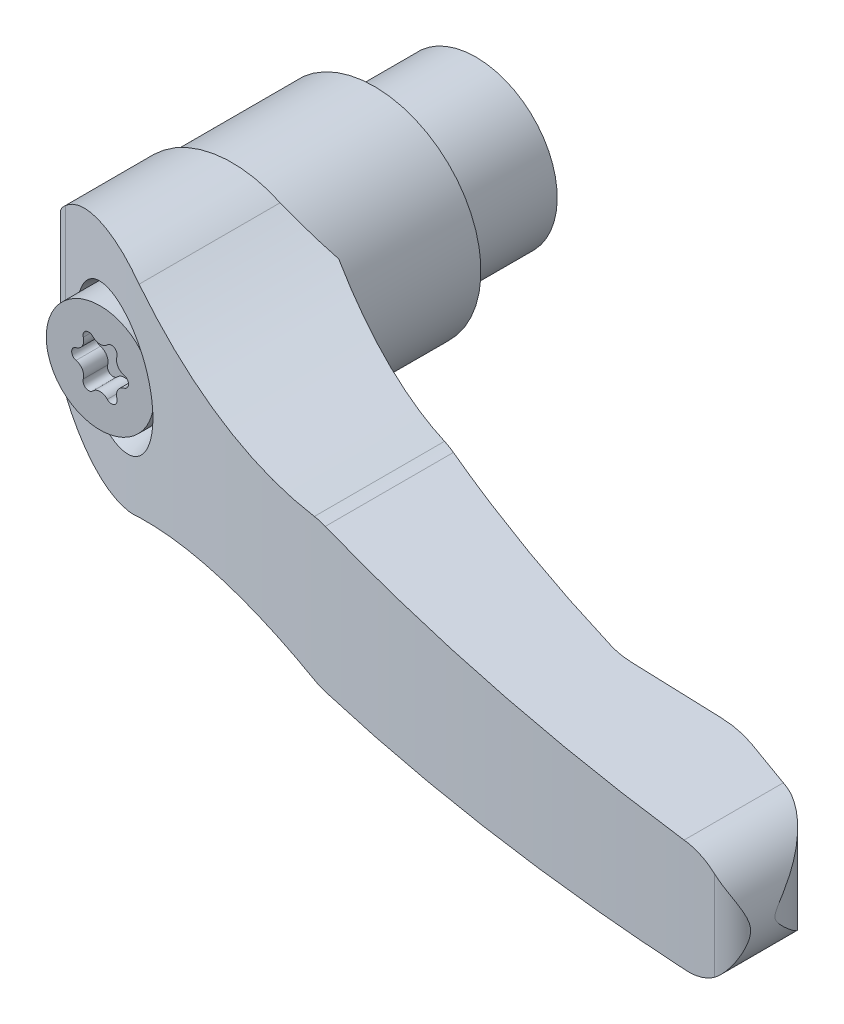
ISO-10303-21;
HEADER;
FILE_DESCRIPTION(('STEP AP214'),'2;1');
FILE_NAME('part.step','',(''),(''),'','','');
FILE_SCHEMA(('AUTOMOTIVE_DESIGN { 1 0 10303 214 1 1 1 1 }'));
ENDSEC;
DATA;
#1=APPLICATION_CONTEXT('core data for automotive mechanical design processes');
#2=APPLICATION_PROTOCOL_DEFINITION('international standard','automotive_design',2000,#1);
#3=PRODUCT_CONTEXT('',#1,'mechanical');
#4=PRODUCT('Part','Part','',(#3));
#5=PRODUCT_RELATED_PRODUCT_CATEGORY('part','',(#4));
#6=PRODUCT_DEFINITION_FORMATION('','',#4);
#7=PRODUCT_DEFINITION_CONTEXT('part definition',#1,'design');
#8=PRODUCT_DEFINITION('design','',#6,#7);
#9=PRODUCT_DEFINITION_SHAPE('','',#8);
#10=(LENGTH_UNIT() NAMED_UNIT(*) SI_UNIT(.MILLI.,.METRE.));
#11=(NAMED_UNIT(*) PLANE_ANGLE_UNIT() SI_UNIT($,.RADIAN.));
#12=(NAMED_UNIT(*) SI_UNIT($,.STERADIAN.) SOLID_ANGLE_UNIT());
#13=UNCERTAINTY_MEASURE_WITH_UNIT(LENGTH_MEASURE(1.E-05),#10,'distance_accuracy_value','');
#14=(GEOMETRIC_REPRESENTATION_CONTEXT(3) GLOBAL_UNCERTAINTY_ASSIGNED_CONTEXT((#13)) GLOBAL_UNIT_ASSIGNED_CONTEXT((#10,
#11,#12)) REPRESENTATION_CONTEXT('',''));
#15=CARTESIAN_POINT('',(0.,0.,0.));
#16=DIRECTION('',(0.,0.,1.));
#17=DIRECTION('',(1.,0.,0.));
#18=AXIS2_PLACEMENT_3D('',#15,#16,#17);
#19=CARTESIAN_POINT('',(1.12000000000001,1.93989690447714,39.4));
#20=DIRECTION('',(0.,0.,1.));
#21=DIRECTION('',(0.,-1.,0.));
#22=AXIS2_PLACEMENT_3D('',#19,#20,#21);
#23=CYLINDRICAL_SURFACE('',#22,0.56);
#24=DIRECTION('',(0.,0.,1.));
#25=VECTOR('',#24,1.);
#26=CARTESIAN_POINT('',(0.712727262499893,2.32425210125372,39.4));
#27=LINE('',#26,#25);
#28=CARTESIAN_POINT('',(0.712727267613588,2.32425210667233,34.6));
#29=VERTEX_POINT('',#28);
#30=CARTESIAN_POINT('',(0.712727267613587,2.32425210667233,37.));
#31=VERTEX_POINT('',#30);
#32=EDGE_CURVE('E229',#29,#31,#27,.T.);
#33=ORIENTED_EDGE('',*,*,#32,.F.);
#34=CARTESIAN_POINT('',(1.12,1.93989690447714,34.6));
#35=DIRECTION('',(0.,0.,1.));
#36=DIRECTION('',(0.,-1.,0.));
#37=AXIS2_PLACEMENT_3D('',#34,#35,#36);
#38=CIRCLE('',#37,0.56);
#39=CARTESIAN_POINT('',(1.65649773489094,1.77936597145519,34.6));
#40=VERTEX_POINT('',#39);
#41=EDGE_CURVE('E222',#40,#29,#38,.T.);
#42=ORIENTED_EDGE('',*,*,#41,.F.);
#43=DIRECTION('',(0.,0.,1.));
#44=VECTOR('',#43,1.);
#45=CARTESIAN_POINT('',(1.65649773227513,1.77936596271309,39.4));
#46=LINE('',#45,#44);
#47=CARTESIAN_POINT('',(1.65649773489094,1.77936597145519,37.));
#48=VERTEX_POINT('',#47);
#49=EDGE_CURVE('E226',#48,#40,#46,.F.);
#50=ORIENTED_EDGE('',*,*,#49,.F.);
#51=CARTESIAN_POINT('',(1.12,1.93989690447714,37.));
#52=DIRECTION('',(0.,0.,1.));
#53=DIRECTION('',(0.,-1.,0.));
#54=AXIS2_PLACEMENT_3D('',#51,#52,#53);
#55=CIRCLE('',#54,0.56);
#56=EDGE_CURVE('E232',#31,#48,#55,.F.);
#57=ORIENTED_EDGE('',*,*,#56,.F.);
#58=EDGE_LOOP('',(#33,#42,#50,#57));
#59=FACE_BOUND('',#58,.T.);
#60=ADVANCED_FACE('F14',(#59),#23,.F.);
#61=CARTESIAN_POINT('',(0.,2.99687372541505,39.4));
#62=DIRECTION('',(0.,0.,1.));
#63=DIRECTION('',(0.,-1.,0.));
#64=AXIS2_PLACEMENT_3D('',#61,#62,#63);
#65=CYLINDRICAL_SURFACE('',#64,0.98);
#66=CARTESIAN_POINT('',(0.,2.99687372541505,34.6));
#67=DIRECTION('',(0.,0.,1.));
#68=DIRECTION('',(0.,-1.,0.));
#69=AXIS2_PLACEMENT_3D('',#66,#67,#68);
#70=CIRCLE('',#69,0.98);
#71=CARTESIAN_POINT('',(-0.712727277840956,2.32425211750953,34.6));
#72=VERTEX_POINT('',#71);
#73=EDGE_CURVE('E253',#72,#29,#70,.T.);
#74=ORIENTED_EDGE('',*,*,#73,.T.);
#75=ORIENTED_EDGE('',*,*,#32,.T.);
#76=CARTESIAN_POINT('',(0.,2.99687372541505,37.));
#77=DIRECTION('',(0.,0.,1.));
#78=DIRECTION('',(0.,-1.,0.));
#79=AXIS2_PLACEMENT_3D('',#76,#77,#78);
#80=CIRCLE('',#79,0.98);
#81=CARTESIAN_POINT('',(-0.712727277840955,2.32425211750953,37.));
#82=VERTEX_POINT('',#81);
#83=EDGE_CURVE('E701',#31,#82,#80,.F.);
#84=ORIENTED_EDGE('',*,*,#83,.T.);
#85=DIRECTION('',(0.,0.,1.));
#86=VECTOR('',#85,1.);
#87=CARTESIAN_POINT('',(-0.712727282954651,2.32425212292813,39.4));
#88=LINE('',#87,#86);
#89=EDGE_CURVE('E243',#82,#72,#88,.F.);
#90=ORIENTED_EDGE('',*,*,#89,.T.);
#91=EDGE_LOOP('',(#74,#75,#84,#90));
#92=FACE_BOUND('',#91,.T.);
#93=ADVANCED_FACE('F546',(#92),#65,.T.);
#94=CARTESIAN_POINT('',(2.59536877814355,1.49843686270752,39.4));
#95=DIRECTION('',(0.,0.,1.));
#96=DIRECTION('',(0.,-1.,0.));
#97=AXIS2_PLACEMENT_3D('',#94,#95,#96);
#98=CYLINDRICAL_SURFACE('',#97,0.98);
#99=CARTESIAN_POINT('',(2.59536877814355,1.49843686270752,34.6));
#100=DIRECTION('',(0.,0.,1.));
#101=DIRECTION('',(0.,-1.,0.));
#102=AXIS2_PLACEMENT_3D('',#99,#100,#101);
#103=CIRCLE('',#102,0.98);
#104=CARTESIAN_POINT('',(2.36922501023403,0.544886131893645,34.6));
#105=VERTEX_POINT('',#104);
#106=EDGE_CURVE('E236',#40,#105,#103,.T.);
#107=ORIENTED_EDGE('',*,*,#106,.T.);
#108=DIRECTION('',(0.,0.,1.));
#109=VECTOR('',#108,1.);
#110=CARTESIAN_POINT('',(2.36922501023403,0.544886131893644,39.4));
#111=LINE('',#110,#109);
#112=CARTESIAN_POINT('',(2.36922501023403,0.544886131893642,37.));
#113=VERTEX_POINT('',#112);
#114=EDGE_CURVE('E687',#105,#113,#111,.T.);
#115=ORIENTED_EDGE('',*,*,#114,.T.);
#116=CARTESIAN_POINT('',(2.59536877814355,1.49843686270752,37.));
#117=DIRECTION('',(0.,0.,1.));
#118=DIRECTION('',(0.,-1.,0.));
#119=AXIS2_PLACEMENT_3D('',#116,#117,#118);
#120=CIRCLE('',#119,0.98);
#121=EDGE_CURVE('E246',#113,#48,#120,.F.);
#122=ORIENTED_EDGE('',*,*,#121,.T.);
#123=ORIENTED_EDGE('',*,*,#49,.T.);
#124=EDGE_LOOP('',(#107,#115,#122,#123));
#125=FACE_BOUND('',#124,.T.);
#126=ADVANCED_FACE('F245',(#125),#98,.T.);
#127=CARTESIAN_POINT('',(-1.11999999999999,1.93989690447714,39.4));
#128=DIRECTION('',(0.,0.,1.));
#129=DIRECTION('',(0.,-1.,0.));
#130=AXIS2_PLACEMENT_3D('',#127,#128,#129);
#131=CYLINDRICAL_SURFACE('',#130,0.56);
#132=DIRECTION('',(0.,0.,1.));
#133=VECTOR('',#132,1.);
#134=CARTESIAN_POINT('',(-1.65649773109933,1.77936595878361,39.4));
#135=LINE('',#134,#133);
#136=CARTESIAN_POINT('',(-1.65649773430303,1.77936596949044,34.6));
#137=VERTEX_POINT('',#136);
#138=CARTESIAN_POINT('',(-1.65649773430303,1.77936596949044,37.));
#139=VERTEX_POINT('',#138);
#140=EDGE_CURVE('E684',#137,#139,#135,.T.);
#141=ORIENTED_EDGE('',*,*,#140,.F.);
#142=CARTESIAN_POINT('',(-1.12,1.93989690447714,34.6));
#143=DIRECTION('',(0.,0.,1.));
#144=DIRECTION('',(0.,-1.,0.));
#145=AXIS2_PLACEMENT_3D('',#142,#143,#144);
#146=CIRCLE('',#145,0.56);
#147=EDGE_CURVE('E695',#72,#137,#146,.T.);
#148=ORIENTED_EDGE('',*,*,#147,.F.);
#149=ORIENTED_EDGE('',*,*,#89,.F.);
#150=CARTESIAN_POINT('',(-1.12,1.93989690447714,37.));
#151=DIRECTION('',(0.,0.,1.));
#152=DIRECTION('',(0.,-1.,0.));
#153=AXIS2_PLACEMENT_3D('',#150,#151,#152);
#154=CIRCLE('',#153,0.56);
#155=EDGE_CURVE('E692',#139,#82,#154,.F.);
#156=ORIENTED_EDGE('',*,*,#155,.F.);
#157=EDGE_LOOP('',(#141,#148,#149,#156));
#158=FACE_BOUND('',#157,.T.);
#159=ADVANCED_FACE('F539',(#158),#131,.F.);
#160=CARTESIAN_POINT('',(2.24,0.,39.4));
#161=DIRECTION('',(0.,0.,1.));
#162=DIRECTION('',(0.,-1.,0.));
#163=AXIS2_PLACEMENT_3D('',#160,#161,#162);
#164=CYLINDRICAL_SURFACE('',#163,0.56);
#165=ORIENTED_EDGE('',*,*,#114,.F.);
#166=CARTESIAN_POINT('',(2.24,0.,34.6));
#167=DIRECTION('',(0.,0.,1.));
#168=DIRECTION('',(0.,-1.,0.));
#169=AXIS2_PLACEMENT_3D('',#166,#167,#168);
#170=CIRCLE('',#169,0.56);
#171=CARTESIAN_POINT('',(2.36922500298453,-0.544886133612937,34.6));
#172=VERTEX_POINT('',#171);
#173=EDGE_CURVE('E239',#172,#105,#170,.T.);
#174=ORIENTED_EDGE('',*,*,#173,.F.);
#175=DIRECTION('',(0.,0.,1.));
#176=VECTOR('',#175,1.);
#177=CARTESIAN_POINT('',(2.36922499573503,-0.544886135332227,39.4));
#178=LINE('',#177,#176);
#179=CARTESIAN_POINT('',(2.36922500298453,-0.544886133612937,37.));
#180=VERTEX_POINT('',#179);
#181=EDGE_CURVE('E679',#180,#172,#178,.F.);
#182=ORIENTED_EDGE('',*,*,#181,.F.);
#183=CARTESIAN_POINT('',(2.24,0.,37.));
#184=DIRECTION('',(0.,0.,1.));
#185=DIRECTION('',(0.,-1.,0.));
#186=AXIS2_PLACEMENT_3D('',#183,#184,#185);
#187=CIRCLE('',#186,0.56);
#188=EDGE_CURVE('E688',#113,#180,#187,.F.);
#189=ORIENTED_EDGE('',*,*,#188,.F.);
#190=EDGE_LOOP('',(#165,#174,#182,#189));
#191=FACE_BOUND('',#190,.T.);
#192=ADVANCED_FACE('F535',(#191),#164,.F.);
#193=CARTESIAN_POINT('',(6.5,0.,0.));
#194=DIRECTION('',(0.,0.,-1.));
#195=DIRECTION('',(0.,1.,0.));
#196=AXIS2_PLACEMENT_3D('',#193,#194,#195);
#197=PLANE('',#196);
#198=CARTESIAN_POINT('',(0.,0.,0.));
#199=DIRECTION('',(0.,0.,-1.));
#200=DIRECTION('',(-1.,0.,0.));
#201=AXIS2_PLACEMENT_3D('',#198,#199,#200);
#202=CIRCLE('',#201,5.64999999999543);
#203=CARTESIAN_POINT('',(-5.64999999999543,0.,0.));
#204=VERTEX_POINT('',#203);
#205=EDGE_CURVE('E9',#204,#204,#202,.F.);
#206=ORIENTED_EDGE('',*,*,#205,.T.);
#207=EDGE_LOOP('',(#206));
#208=FACE_BOUND('',#207,.T.);
#209=CARTESIAN_POINT('',(0.,0.,0.));
#210=DIRECTION('',(0.,0.,-1.));
#211=DIRECTION('',(0.,1.,0.));
#212=AXIS2_PLACEMENT_3D('',#209,#210,#211);
#213=CIRCLE('',#212,8.);
#214=CARTESIAN_POINT('',(0.,8.,0.));
#215=VERTEX_POINT('',#214);
#216=EDGE_CURVE('E678',#215,#215,#213,.F.);
#217=ORIENTED_EDGE('',*,*,#216,.F.);
#218=EDGE_LOOP('',(#217));
#219=FACE_BOUND('',#218,.T.);
#220=ADVANCED_FACE('F531',(#208,#219),#197,.T.);
#221=CARTESIAN_POINT('',(-2.59536877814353,1.49843686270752,39.4));
#222=DIRECTION('',(0.,0.,1.));
#223=DIRECTION('',(0.,-1.,0.));
#224=AXIS2_PLACEMENT_3D('',#221,#222,#223);
#225=CYLINDRICAL_SURFACE('',#224,0.98);
#226=CARTESIAN_POINT('',(-2.59536877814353,1.49843686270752,34.6));
#227=DIRECTION('',(0.,0.,1.));
#228=DIRECTION('',(0.,-1.,0.));
#229=AXIS2_PLACEMENT_3D('',#226,#227,#228);
#230=CIRCLE('',#229,0.98);
#231=CARTESIAN_POINT('',(-2.369225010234,0.544886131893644,34.6));
#232=VERTEX_POINT('',#231);
#233=EDGE_CURVE('E686',#232,#137,#230,.T.);
#234=ORIENTED_EDGE('',*,*,#233,.T.);
#235=ORIENTED_EDGE('',*,*,#140,.T.);
#236=CARTESIAN_POINT('',(-2.59536877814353,1.49843686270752,37.));
#237=DIRECTION('',(0.,0.,1.));
#238=DIRECTION('',(0.,-1.,0.));
#239=AXIS2_PLACEMENT_3D('',#236,#237,#238);
#240=CIRCLE('',#239,0.98);
#241=CARTESIAN_POINT('',(-2.369225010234,0.544886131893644,37.));
#242=VERTEX_POINT('',#241);
#243=EDGE_CURVE('E690',#139,#242,#240,.F.);
#244=ORIENTED_EDGE('',*,*,#243,.T.);
#245=DIRECTION('',(0.,0.,1.));
#246=VECTOR('',#245,1.);
#247=CARTESIAN_POINT('',(-2.369225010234,0.544886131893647,39.4));
#248=LINE('',#247,#246);
#249=EDGE_CURVE('E674',#242,#232,#248,.F.);
#250=ORIENTED_EDGE('',*,*,#249,.T.);
#251=EDGE_LOOP('',(#234,#235,#244,#250));
#252=FACE_BOUND('',#251,.T.);
#253=ADVANCED_FACE('F527',(#252),#225,.T.);
#254=CARTESIAN_POINT('',(2.59536877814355,-1.49843686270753,39.4));
#255=DIRECTION('',(0.,0.,1.));
#256=DIRECTION('',(0.,-1.,0.));
#257=AXIS2_PLACEMENT_3D('',#254,#255,#256);
#258=CYLINDRICAL_SURFACE('',#257,0.98);
#259=CARTESIAN_POINT('',(2.59536877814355,-1.49843686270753,34.6));
#260=DIRECTION('',(0.,0.,1.));
#261=DIRECTION('',(0.,-1.,0.));
#262=AXIS2_PLACEMENT_3D('',#259,#260,#261);
#263=CIRCLE('',#262,0.98);
#264=CARTESIAN_POINT('',(1.65649774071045,-1.77936599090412,34.6));
#265=VERTEX_POINT('',#264);
#266=EDGE_CURVE('E682',#172,#265,#263,.T.);
#267=ORIENTED_EDGE('',*,*,#266,.T.);
#268=DIRECTION('',(0.,0.,1.));
#269=VECTOR('',#268,1.);
#270=CARTESIAN_POINT('',(1.65649774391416,-1.77936600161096,39.4));
#271=LINE('',#270,#269);
#272=CARTESIAN_POINT('',(1.65649774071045,-1.77936599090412,37.));
#273=VERTEX_POINT('',#272);
#274=EDGE_CURVE('E661',#265,#273,#271,.T.);
#275=ORIENTED_EDGE('',*,*,#274,.T.);
#276=CARTESIAN_POINT('',(2.59536877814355,-1.49843686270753,37.));
#277=DIRECTION('',(0.,0.,1.));
#278=DIRECTION('',(0.,-1.,0.));
#279=AXIS2_PLACEMENT_3D('',#276,#277,#278);
#280=CIRCLE('',#279,0.98);
#281=EDGE_CURVE('E683',#273,#180,#280,.F.);
#282=ORIENTED_EDGE('',*,*,#281,.T.);
#283=ORIENTED_EDGE('',*,*,#181,.T.);
#284=EDGE_LOOP('',(#267,#275,#282,#283));
#285=FACE_BOUND('',#284,.T.);
#286=ADVANCED_FACE('F523',(#285),#258,.T.);
#287=CARTESIAN_POINT('',(0.,0.,11.15));
#288=DIRECTION('',(0.,0.,-1.));
#289=DIRECTION('',(0.,1.,0.));
#290=AXIS2_PLACEMENT_3D('',#287,#288,#289);
#291=CYLINDRICAL_SURFACE('',#290,8.);
#292=ORIENTED_EDGE('',*,*,#216,.T.);
#293=EDGE_LOOP('',(#292));
#294=FACE_BOUND('',#293,.T.);
#295=CARTESIAN_POINT('',(0.,0.,10.7));
#296=DIRECTION('',(0.,0.,-1.));
#297=DIRECTION('',(1.,0.,0.));
#298=AXIS2_PLACEMENT_3D('',#295,#296,#297);
#299=CIRCLE('',#298,8.);
#300=CARTESIAN_POINT('',(8.,0.,10.7));
#301=VERTEX_POINT('',#300);
#302=EDGE_CURVE('E671',#301,#301,#299,.T.);
#303=ORIENTED_EDGE('',*,*,#302,.T.);
#304=EDGE_LOOP('',(#303));
#305=FACE_BOUND('',#304,.T.);
#306=ADVANCED_FACE('F519',(#294,#305),#291,.T.);
#307=CARTESIAN_POINT('',(-2.24,0.,39.4));
#308=DIRECTION('',(0.,0.,1.));
#309=DIRECTION('',(0.,-1.,0.));
#310=AXIS2_PLACEMENT_3D('',#307,#308,#309);
#311=CYLINDRICAL_SURFACE('',#310,0.56);
#312=DIRECTION('',(0.,0.,1.));
#313=VECTOR('',#312,1.);
#314=CARTESIAN_POINT('',(-2.3692250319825,-0.544886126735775,39.4));
#315=LINE('',#314,#313);
#316=CARTESIAN_POINT('',(-2.36922502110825,-0.54488612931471,34.6));
#317=VERTEX_POINT('',#316);
#318=CARTESIAN_POINT('',(-2.36922502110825,-0.544886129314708,37.));
#319=VERTEX_POINT('',#318);
#320=EDGE_CURVE('E666',#317,#319,#315,.T.);
#321=ORIENTED_EDGE('',*,*,#320,.F.);
#322=CARTESIAN_POINT('',(-2.24,0.,34.6));
#323=DIRECTION('',(0.,0.,1.));
#324=DIRECTION('',(0.,-1.,0.));
#325=AXIS2_PLACEMENT_3D('',#322,#323,#324);
#326=CIRCLE('',#325,0.56);
#327=EDGE_CURVE('E677',#232,#317,#326,.T.);
#328=ORIENTED_EDGE('',*,*,#327,.F.);
#329=ORIENTED_EDGE('',*,*,#249,.F.);
#330=CARTESIAN_POINT('',(-2.24,0.,37.));
#331=DIRECTION('',(0.,0.,1.));
#332=DIRECTION('',(0.,-1.,0.));
#333=AXIS2_PLACEMENT_3D('',#330,#331,#332);
#334=CIRCLE('',#333,0.56);
#335=EDGE_CURVE('E665',#319,#242,#334,.F.);
#336=ORIENTED_EDGE('',*,*,#335,.F.);
#337=EDGE_LOOP('',(#321,#328,#329,#336));
#338=FACE_BOUND('',#337,.T.);
#339=ADVANCED_FACE('F515',(#338),#311,.F.);
#340=CARTESIAN_POINT('',(1.12000000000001,-1.93989690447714,39.4));
#341=DIRECTION('',(0.,0.,1.));
#342=DIRECTION('',(0.,-1.,0.));
#343=AXIS2_PLACEMENT_3D('',#340,#341,#342);
#344=CYLINDRICAL_SURFACE('',#343,0.56);
#345=ORIENTED_EDGE('',*,*,#274,.F.);
#346=CARTESIAN_POINT('',(1.12,-1.93989690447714,34.6));
#347=DIRECTION('',(0.,0.,1.));
#348=DIRECTION('',(0.,-1.,0.));
#349=AXIS2_PLACEMENT_3D('',#346,#347,#348);
#350=CIRCLE('',#349,0.56);
#351=CARTESIAN_POINT('',(0.712727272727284,-2.32425211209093,34.6));
#352=VERTEX_POINT('',#351);
#353=EDGE_CURVE('E1093',#352,#265,#350,.T.);
#354=ORIENTED_EDGE('',*,*,#353,.F.);
#355=DIRECTION('',(0.,0.,1.));
#356=VECTOR('',#355,1.);
#357=CARTESIAN_POINT('',(0.712727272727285,-2.32425211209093,39.4));
#358=LINE('',#357,#356);
#359=CARTESIAN_POINT('',(0.712727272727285,-2.32425211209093,37.));
#360=VERTEX_POINT('',#359);
#361=EDGE_CURVE('E657',#360,#352,#358,.F.);
#362=ORIENTED_EDGE('',*,*,#361,.F.);
#363=CARTESIAN_POINT('',(1.12,-1.93989690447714,37.));
#364=DIRECTION('',(0.,0.,1.));
#365=DIRECTION('',(0.,-1.,0.));
#366=AXIS2_PLACEMENT_3D('',#363,#364,#365);
#367=CIRCLE('',#366,0.56);
#368=EDGE_CURVE('E664',#273,#360,#367,.F.);
#369=ORIENTED_EDGE('',*,*,#368,.F.);
#370=EDGE_LOOP('',(#345,#354,#362,#369));
#371=FACE_BOUND('',#370,.T.);
#372=ADVANCED_FACE('F511',(#371),#344,.F.);
#373=CARTESIAN_POINT('',(0.,0.,10.4));
#374=DIRECTION('',(0.,0.,-1.));
#375=DIRECTION('',(0.,1.,0.));
#376=AXIS2_PLACEMENT_3D('',#373,#374,#375);
#377=CONICAL_SURFACE('',#376,8.3,0.785398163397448);
#378=ORIENTED_EDGE('',*,*,#302,.F.);
#379=EDGE_LOOP('',(#378));
#380=FACE_BOUND('',#379,.T.);
#381=CARTESIAN_POINT('',(0.,0.,10.4));
#382=DIRECTION('',(0.,0.,-1.));
#383=DIRECTION('',(0.,1.,0.));
#384=AXIS2_PLACEMENT_3D('',#381,#382,#383);
#385=CIRCLE('',#384,8.3);
#386=CARTESIAN_POINT('',(0.,8.3,10.4));
#387=VERTEX_POINT('',#386);
#388=EDGE_CURVE('E653',#387,#387,#385,.T.);
#389=ORIENTED_EDGE('',*,*,#388,.T.);
#390=EDGE_LOOP('',(#389));
#391=FACE_BOUND('',#390,.T.);
#392=ADVANCED_FACE('F507',(#380,#391),#377,.F.);
#393=CARTESIAN_POINT('',(-2.59536877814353,-1.49843686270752,39.4));
#394=DIRECTION('',(0.,0.,1.));
#395=DIRECTION('',(0.,-1.,0.));
#396=AXIS2_PLACEMENT_3D('',#393,#394,#395);
#397=CYLINDRICAL_SURFACE('',#396,0.98);
#398=CARTESIAN_POINT('',(-2.59536877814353,-1.49843686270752,34.6));
#399=DIRECTION('',(0.,0.,1.));
#400=DIRECTION('',(0.,-1.,0.));
#401=AXIS2_PLACEMENT_3D('',#398,#399,#400);
#402=CIRCLE('',#401,0.98);
#403=CARTESIAN_POINT('',(-1.65649773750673,-1.77936598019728,34.6));
#404=VERTEX_POINT('',#403);
#405=EDGE_CURVE('E669',#317,#404,#402,.F.);
#406=ORIENTED_EDGE('',*,*,#405,.F.);
#407=ORIENTED_EDGE('',*,*,#320,.T.);
#408=CARTESIAN_POINT('',(-2.59536877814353,-1.49843686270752,37.));
#409=DIRECTION('',(0.,0.,1.));
#410=DIRECTION('',(0.,-1.,0.));
#411=AXIS2_PLACEMENT_3D('',#408,#409,#410);
#412=CIRCLE('',#411,0.98);
#413=CARTESIAN_POINT('',(-1.65649773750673,-1.77936598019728,37.));
#414=VERTEX_POINT('',#413);
#415=EDGE_CURVE('E670',#319,#414,#412,.F.);
#416=ORIENTED_EDGE('',*,*,#415,.T.);
#417=DIRECTION('',(0.,0.,1.));
#418=VECTOR('',#417,1.);
#419=CARTESIAN_POINT('',(-1.65649773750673,-1.77936598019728,39.4));
#420=LINE('',#419,#418);
#421=EDGE_CURVE('E651',#414,#404,#420,.F.);
#422=ORIENTED_EDGE('',*,*,#421,.T.);
#423=EDGE_LOOP('',(#406,#407,#416,#422));
#424=FACE_BOUND('',#423,.T.);
#425=ADVANCED_FACE('F504',(#424),#397,.T.);
#426=CARTESIAN_POINT('',(0.,0.,34.6));
#427=DIRECTION('',(0.,0.,1.));
#428=DIRECTION('',(0.,-1.,0.));
#429=AXIS2_PLACEMENT_3D('',#426,#427,#428);
#430=PLANE('',#429);
#431=ORIENTED_EDGE('',*,*,#233,.F.);
#432=ORIENTED_EDGE('',*,*,#327,.T.);
#433=ORIENTED_EDGE('',*,*,#405,.T.);
#434=CARTESIAN_POINT('',(-1.12,-1.93989690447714,34.6));
#435=DIRECTION('',(0.,0.,1.));
#436=DIRECTION('',(0.,-1.,0.));
#437=AXIS2_PLACEMENT_3D('',#434,#435,#436);
#438=CIRCLE('',#437,0.56);
#439=CARTESIAN_POINT('',(-0.712727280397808,-2.32425212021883,34.6));
#440=VERTEX_POINT('',#439);
#441=EDGE_CURVE('E650',#404,#440,#438,.T.);
#442=ORIENTED_EDGE('',*,*,#441,.T.);
#443=CARTESIAN_POINT('',(0.,-2.99687372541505,34.6));
#444=DIRECTION('',(0.,0.,1.));
#445=DIRECTION('',(0.,-1.,0.));
#446=AXIS2_PLACEMENT_3D('',#443,#444,#445);
#447=CIRCLE('',#446,0.98);
#448=EDGE_CURVE('E656',#352,#440,#447,.T.);
#449=ORIENTED_EDGE('',*,*,#448,.F.);
#450=ORIENTED_EDGE('',*,*,#353,.T.);
#451=ORIENTED_EDGE('',*,*,#266,.F.);
#452=ORIENTED_EDGE('',*,*,#173,.T.);
#453=ORIENTED_EDGE('',*,*,#106,.F.);
#454=ORIENTED_EDGE('',*,*,#41,.T.);
#455=ORIENTED_EDGE('',*,*,#73,.F.);
#456=ORIENTED_EDGE('',*,*,#147,.T.);
#457=EDGE_LOOP('',(#431,#432,#433,#442,#449,#450,#451,#452,#453,#454,#455,#456));
#458=FACE_BOUND('',#457,.T.);
#459=ADVANCED_FACE('F237',(#458),#430,.T.);
#460=CARTESIAN_POINT('',(0.,-2.99687372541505,39.4));
#461=DIRECTION('',(0.,0.,1.));
#462=DIRECTION('',(0.,-1.,0.));
#463=AXIS2_PLACEMENT_3D('',#460,#461,#462);
#464=CYLINDRICAL_SURFACE('',#463,0.98);
#465=ORIENTED_EDGE('',*,*,#448,.T.);
#466=DIRECTION('',(0.,0.,1.));
#467=VECTOR('',#466,1.);
#468=CARTESIAN_POINT('',(-0.712727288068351,-2.32425212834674,39.4));
#469=LINE('',#468,#467);
#470=CARTESIAN_POINT('',(-0.712727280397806,-2.32425212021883,37.));
#471=VERTEX_POINT('',#470);
#472=EDGE_CURVE('E647',#440,#471,#469,.T.);
#473=ORIENTED_EDGE('',*,*,#472,.T.);
#474=CARTESIAN_POINT('',(0.,-2.99687372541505,37.));
#475=DIRECTION('',(0.,0.,1.));
#476=DIRECTION('',(0.,-1.,0.));
#477=AXIS2_PLACEMENT_3D('',#474,#475,#476);
#478=CIRCLE('',#477,0.98);
#479=EDGE_CURVE('E660',#471,#360,#478,.F.);
#480=ORIENTED_EDGE('',*,*,#479,.T.);
#481=ORIENTED_EDGE('',*,*,#361,.T.);
#482=EDGE_LOOP('',(#465,#473,#480,#481));
#483=FACE_BOUND('',#482,.T.);
#484=ADVANCED_FACE('F497',(#483),#464,.T.);
#485=CARTESIAN_POINT('',(0.,0.,9.7));
#486=DIRECTION('',(0.,0.,-1.));
#487=DIRECTION('',(0.,1.,0.));
#488=AXIS2_PLACEMENT_3D('',#485,#486,#487);
#489=CYLINDRICAL_SURFACE('',#488,8.3);
#490=ORIENTED_EDGE('',*,*,#388,.F.);
#491=EDGE_LOOP('',(#490));
#492=FACE_BOUND('',#491,.T.);
#493=CARTESIAN_POINT('',(0.,0.,10.));
#494=DIRECTION('',(0.,0.,-1.));
#495=DIRECTION('',(0.,1.,0.));
#496=AXIS2_PLACEMENT_3D('',#493,#494,#495);
#497=CIRCLE('',#496,8.3);
#498=CARTESIAN_POINT('',(0.,8.3,10.));
#499=VERTEX_POINT('',#498);
#500=EDGE_CURVE('E572',#499,#499,#497,.F.);
#501=ORIENTED_EDGE('',*,*,#500,.F.);
#502=EDGE_LOOP('',(#501));
#503=FACE_BOUND('',#502,.T.);
#504=ADVANCED_FACE('F493',(#492,#503),#489,.F.);
#505=CARTESIAN_POINT('',(-1.11999999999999,-1.93989690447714,39.4));
#506=DIRECTION('',(0.,0.,1.));
#507=DIRECTION('',(0.,-1.,0.));
#508=AXIS2_PLACEMENT_3D('',#505,#506,#507);
#509=CYLINDRICAL_SURFACE('',#508,0.56);
#510=ORIENTED_EDGE('',*,*,#472,.F.);
#511=ORIENTED_EDGE('',*,*,#441,.F.);
#512=ORIENTED_EDGE('',*,*,#421,.F.);
#513=CARTESIAN_POINT('',(-1.12,-1.93989690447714,37.));
#514=DIRECTION('',(0.,0.,1.));
#515=DIRECTION('',(0.,-1.,0.));
#516=AXIS2_PLACEMENT_3D('',#513,#514,#515);
#517=CIRCLE('',#516,0.56);
#518=EDGE_CURVE('E571',#471,#414,#517,.F.);
#519=ORIENTED_EDGE('',*,*,#518,.F.);
#520=EDGE_LOOP('',(#510,#511,#512,#519));
#521=FACE_BOUND('',#520,.T.);
#522=ADVANCED_FACE('F489',(#521),#509,.F.);
#523=CARTESIAN_POINT('',(-5.26,0.,10.));
#524=DIRECTION('',(0.,0.,-1.));
#525=DIRECTION('',(0.,1.,0.));
#526=AXIS2_PLACEMENT_3D('',#523,#524,#525);
#527=PLANE('',#526);
#528=CARTESIAN_POINT('',(-0.00999999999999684,0.,10.));
#529=DIRECTION('',(0.,0.,1.));
#530=DIRECTION('',(-1.,0.,0.));
#531=AXIS2_PLACEMENT_3D('',#528,#529,#530);
#532=CIRCLE('',#531,10.5);
#533=CARTESIAN_POINT('',(-10.2600377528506,-2.27743848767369,10.));
#534=VERTEX_POINT('',#533);
#535=CARTESIAN_POINT('',(-10.2600377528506,2.27743848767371,10.));
#536=VERTEX_POINT('',#535);
#537=EDGE_CURVE('E1102',#534,#536,#532,.T.);
#538=ORIENTED_EDGE('',*,*,#537,.F.);
#539=DIRECTION('',(0.,-1.,0.));
#540=VECTOR('',#539,1.);
#541=CARTESIAN_POINT('',(-10.2600377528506,-22.,10.));
#542=LINE('',#541,#540);
#543=EDGE_CURVE('E569',#534,#536,#542,.F.);
#544=ORIENTED_EDGE('',*,*,#543,.T.);
#545=EDGE_LOOP('',(#538,#544));
#546=FACE_BOUND('',#545,.T.);
#547=ORIENTED_EDGE('',*,*,#500,.T.);
#548=EDGE_LOOP('',(#547));
#549=FACE_BOUND('',#548,.T.);
#550=ADVANCED_FACE('F485',(#546,#549),#527,.T.);
#551=CARTESIAN_POINT('',(-10.2600377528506,-22.,10.));
#552=DIRECTION('',(0.707106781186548,0.,0.707106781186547));
#553=DIRECTION('',(-0.707106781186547,0.,0.707106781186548));
#554=AXIS2_PLACEMENT_3D('',#551,#552,#553);
#555=PLANE('',#554);
#556=ORIENTED_EDGE('',*,*,#543,.F.);
#557=CARTESIAN_POINT('',(-0.00999999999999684,0.,-0.250037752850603));
#558=DIRECTION('',(0.707106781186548,0.,0.707106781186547));
#559=DIRECTION('',(-0.707106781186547,0.,0.707106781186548));
#560=AXIS2_PLACEMENT_3D('',#557,#558,#559);
#561=ELLIPSE('',#560,14.8492424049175,10.5);
#562=EDGE_CURVE('E1105',#536,#534,#561,.T.);
#563=ORIENTED_EDGE('',*,*,#562,.F.);
#564=EDGE_LOOP('',(#556,#563));
#565=FACE_BOUND('',#564,.T.);
#566=ADVANCED_FACE('F481',(#565),#555,.F.);
#567=CARTESIAN_POINT('',(2.65,0.,37.));
#568=DIRECTION('',(0.,0.,1.));
#569=DIRECTION('',(0.,-1.,0.));
#570=AXIS2_PLACEMENT_3D('',#567,#568,#569);
#571=PLANE('',#570);
#572=CARTESIAN_POINT('',(0.,0.,37.));
#573=DIRECTION('',(0.,0.,-1.));
#574=DIRECTION('',(0.,1.,0.));
#575=AXIS2_PLACEMENT_3D('',#572,#573,#574);
#576=CIRCLE('',#575,5.3);
#577=CARTESIAN_POINT('',(0.,5.3,37.));
#578=VERTEX_POINT('',#577);
#579=EDGE_CURVE('E1106',#578,#578,#576,.T.);
#580=ORIENTED_EDGE('',*,*,#579,.F.);
#581=EDGE_LOOP('',(#580));
#582=FACE_BOUND('',#581,.T.);
#583=ORIENTED_EDGE('',*,*,#479,.F.);
#584=ORIENTED_EDGE('',*,*,#518,.T.);
#585=ORIENTED_EDGE('',*,*,#415,.F.);
#586=ORIENTED_EDGE('',*,*,#335,.T.);
#587=ORIENTED_EDGE('',*,*,#243,.F.);
#588=ORIENTED_EDGE('',*,*,#155,.T.);
#589=ORIENTED_EDGE('',*,*,#83,.F.);
#590=ORIENTED_EDGE('',*,*,#56,.T.);
#591=ORIENTED_EDGE('',*,*,#121,.F.);
#592=ORIENTED_EDGE('',*,*,#188,.T.);
#593=ORIENTED_EDGE('',*,*,#281,.F.);
#594=ORIENTED_EDGE('',*,*,#368,.T.);
#595=EDGE_LOOP('',(#583,#584,#585,#586,#587,#588,#589,#590,#591,#592,#593,#594));
#596=FACE_BOUND('',#595,.T.);
#597=ADVANCED_FACE('F477',(#582,#596),#571,.T.);
#598=CARTESIAN_POINT('',(-0.00999999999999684,0.,18.90625));
#599=DIRECTION('',(0.,0.,1.));
#600=DIRECTION('',(-1.,0.,0.));
#601=AXIS2_PLACEMENT_3D('',#598,#599,#600);
#602=CYLINDRICAL_SURFACE('',#601,10.5);
#603=CARTESIAN_POINT('',(-0.00999999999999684,0.,24.));
#604=DIRECTION('',(0.,0.,1.));
#605=DIRECTION('',(-1.,0.,0.));
#606=AXIS2_PLACEMENT_3D('',#603,#604,#605);
#607=CIRCLE('',#606,10.5);
#608=CARTESIAN_POINT('',(-10.51,0.,24.));
#609=VERTEX_POINT('',#608);
#610=CARTESIAN_POINT('',(10.49,0.,24.));
#611=VERTEX_POINT('',#610);
#612=EDGE_CURVE('E458',#609,#611,#607,.T.);
#613=ORIENTED_EDGE('',*,*,#612,.F.);
#614=CARTESIAN_POINT('',(-0.00999999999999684,0.,24.));
#615=DIRECTION('',(0.,0.,1.));
#616=DIRECTION('',(-1.,0.,0.));
#617=AXIS2_PLACEMENT_3D('',#614,#615,#616);
#618=CIRCLE('',#617,10.5);
#619=EDGE_CURVE('E586',#611,#609,#618,.T.);
#620=ORIENTED_EDGE('',*,*,#619,.F.);
#621=EDGE_LOOP('',(#613,#620));
#622=FACE_BOUND('',#621,.T.);
#623=ORIENTED_EDGE('',*,*,#537,.T.);
#624=ORIENTED_EDGE('',*,*,#562,.T.);
#625=EDGE_LOOP('',(#623,#624));
#626=FACE_BOUND('',#625,.T.);
#627=ADVANCED_FACE('F473',(#622,#626),#602,.T.);
#628=CARTESIAN_POINT('',(0.,0.,34.8745));
#629=DIRECTION('',(0.,0.,-1.));
#630=DIRECTION('',(0.,1.,0.));
#631=AXIS2_PLACEMENT_3D('',#628,#629,#630);
#632=CYLINDRICAL_SURFACE('',#631,5.3);
#633=ORIENTED_EDGE('',*,*,#579,.T.);
#634=EDGE_LOOP('',(#633));
#635=FACE_BOUND('',#634,.T.);
#636=CARTESIAN_POINT('',(0.,0.,32.75));
#637=DIRECTION('',(0.,0.,1.));
#638=DIRECTION('',(1.,0.,0.));
#639=AXIS2_PLACEMENT_3D('',#636,#637,#638);
#640=CIRCLE('',#639,5.3);
#641=CARTESIAN_POINT('',(5.30000000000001,0.,32.75));
#642=VERTEX_POINT('',#641);
#643=EDGE_CURVE('E591',#642,#642,#640,.T.);
#644=ORIENTED_EDGE('',*,*,#643,.T.);
#645=EDGE_LOOP('',(#644));
#646=FACE_BOUND('',#645,.T.);
#647=ADVANCED_FACE('F469',(#635,#646),#632,.T.);
#648=CARTESIAN_POINT('',(-10.51,-12.,24.));
#649=DIRECTION('',(0.,0.,-1.));
#650=DIRECTION('',(0.,1.,0.));
#651=AXIS2_PLACEMENT_3D('',#648,#649,#650);
#652=PLANE('',#651);
#653=ORIENTED_EDGE('',*,*,#612,.T.);
#654=DIRECTION('',(0.,-1.,0.));
#655=VECTOR('',#654,1.);
#656=CARTESIAN_POINT('',(10.4900000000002,-12.,23.9999999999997));
#657=LINE('',#656,#655);
#658=CARTESIAN_POINT('',(10.4900000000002,-8.03465812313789,24.));
#659=VERTEX_POINT('',#658);
#660=EDGE_CURVE('E444',#611,#659,#657,.T.);
#661=ORIENTED_EDGE('',*,*,#660,.T.);
#662=CARTESIAN_POINT('',(22.94,-55.53,24.));
#663=DIRECTION('',(0.,0.,1.));
#664=DIRECTION('',(0.,-1.,0.));
#665=AXIS2_PLACEMENT_3D('',#662,#663,#664);
#666=CIRCLE('',#665,49.1);
#667=CARTESIAN_POINT('',(4.72251026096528,-9.93468151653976,24.));
#668=VERTEX_POINT('',#667);
#669=EDGE_CURVE('E598',#659,#668,#666,.T.);
#670=ORIENTED_EDGE('',*,*,#669,.T.);
#671=CARTESIAN_POINT('',(0.,0.,24.));
#672=DIRECTION('',(0.,0.,1.));
#673=DIRECTION('',(0.,-1.,0.));
#674=AXIS2_PLACEMENT_3D('',#671,#672,#673);
#675=CIRCLE('',#674,11.);
#676=CARTESIAN_POINT('',(-10.51,-3.24652121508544,24.));
#677=VERTEX_POINT('',#676);
#678=EDGE_CURVE('E590',#677,#668,#675,.T.);
#679=ORIENTED_EDGE('',*,*,#678,.F.);
#680=DIRECTION('',(0.,-1.,0.));
#681=VECTOR('',#680,1.);
#682=CARTESIAN_POINT('',(-10.51,-12.,24.));
#683=LINE('',#682,#681);
#684=EDGE_CURVE('E633',#609,#677,#683,.T.);
#685=ORIENTED_EDGE('',*,*,#684,.F.);
#686=EDGE_LOOP('',(#653,#661,#670,#679,#685));
#687=FACE_BOUND('',#686,.T.);
#688=ADVANCED_FACE('F464',(#687),#652,.T.);
#689=CARTESIAN_POINT('',(31.3589689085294,0.945932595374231,54.5));
#690=DIRECTION('',(0.,0.,1.));
#691=DIRECTION('',(0.,-1.,0.));
#692=AXIS2_PLACEMENT_3D('',#689,#690,#691);
#693=CYLINDRICAL_SURFACE('',#692,8.00000000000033);
#694=CARTESIAN_POINT('',(31.6479325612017,-7.04884695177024,46.4731806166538));
#695=CARTESIAN_POINT('',(31.4018180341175,-7.05768532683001,46.4087993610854));
#696=CARTESIAN_POINT('',(31.1563854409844,-7.05525330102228,46.3442255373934));
#697=CARTESIAN_POINT('',(30.66688412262,-7.02784844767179,46.2146927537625));
#698=CARTESIAN_POINT('',(30.4228153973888,-7.00287562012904,46.1497337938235));
#699=CARTESIAN_POINT('',(30.1794286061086,-6.96663239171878,46.0845822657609));
#700=B_SPLINE_CURVE_WITH_KNOTS('',3,(#694,#695,#696,#697,#698,#699),.UNSPECIFIED.,.F.,.F.,(4,2,
4),(0.,0.761390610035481,1.52278122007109),.UNSPECIFIED.);
#701=CARTESIAN_POINT('',(31.6479325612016,-7.04884695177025,46.4731806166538));
#702=VERTEX_POINT('',#701);
#703=CARTESIAN_POINT('',(30.1794286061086,-6.96663239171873,46.0845822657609));
#704=VERTEX_POINT('',#703);
#705=EDGE_CURVE('E451',#702,#704,#700,.T.);
#706=ORIENTED_EDGE('',*,*,#705,.T.);
#707=DIRECTION('',(0.,0.,1.));
#708=VECTOR('',#707,1.);
#709=CARTESIAN_POINT('',(30.1794286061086,-6.96663239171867,54.5));
#710=LINE('',#709,#708);
#711=CARTESIAN_POINT('',(30.1794286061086,-6.96663239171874,33.2732494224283));
#712=VERTEX_POINT('',#711);
#713=EDGE_CURVE('E592',#704,#712,#710,.F.);
#714=ORIENTED_EDGE('',*,*,#713,.T.);
#715=CARTESIAN_POINT('',(30.1794286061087,-6.9666323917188,33.2732494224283));
#716=CARTESIAN_POINT('',(30.4222007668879,-7.00282816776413,33.3728739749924));
#717=CARTESIAN_POINT('',(30.6665043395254,-7.02781937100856,33.4725985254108));
#718=CARTESIAN_POINT('',(31.0339219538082,-7.04840105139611,33.6217860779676));
#719=CARTESIAN_POINT('',(31.1565128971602,-7.05244559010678,33.6714318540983));
#720=CARTESIAN_POINT('',(31.4020580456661,-7.05489552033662,33.7706062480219));
#721=CARTESIAN_POINT('',(31.5250125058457,-7.05329063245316,33.8201344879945));
#722=CARTESIAN_POINT('',(31.6479325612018,-7.04884695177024,33.8695155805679));
#723=B_SPLINE_CURVE_WITH_KNOTS('',3,(#715,#716,#717,#718,#719,#720,#721,#722),.UNSPECIFIED.,.F.,
.F.,(4,2,2,4),(0.,0.794258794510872,1.19111760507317,1.58869889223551),.UNSPECIFIED.);
#724=CARTESIAN_POINT('',(31.6479325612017,-7.04884695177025,33.8695155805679));
#725=VERTEX_POINT('',#724);
#726=EDGE_CURVE('E446',#712,#725,#723,.T.);
#727=ORIENTED_EDGE('',*,*,#726,.T.);
#728=DIRECTION('',(0.,0.,1.));
#729=VECTOR('',#728,1.);
#730=CARTESIAN_POINT('',(31.6479325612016,-7.04884695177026,54.5));
#731=LINE('',#730,#729);
#732=EDGE_CURVE('E603',#725,#702,#731,.T.);
#733=ORIENTED_EDGE('',*,*,#732,.T.);
#734=EDGE_LOOP('',(#706,#714,#727,#733));
#735=FACE_BOUND('',#734,.T.);
#736=ADVANCED_FACE('F460',(#735),#693,.T.);
#737=CARTESIAN_POINT('',(79.9967051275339,-12.,50.5395921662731));
#738=DIRECTION('',(0.992331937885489,0.,-0.123601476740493));
#739=DIRECTION('',(0.123601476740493,0.,0.992331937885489));
#740=AXIS2_PLACEMENT_3D('',#737,#738,#739);
#741=PLANE('',#740);
#742=CARTESIAN_POINT('',(79.9967051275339,-0.190348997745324,50.5395921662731));
#743=CARTESIAN_POINT('',(79.9969785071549,-0.182455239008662,50.5417867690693));
#744=CARTESIAN_POINT('',(79.9972360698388,-0.174525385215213,50.543854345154));
#745=CARTESIAN_POINT('',(79.9977166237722,-0.158664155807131,50.5477118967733));
#746=CARTESIAN_POINT('',(79.9979398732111,-0.150733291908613,50.5495039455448));
#747=CARTESIAN_POINT('',(79.9983518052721,-0.134870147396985,50.5528105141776));
#748=CARTESIAN_POINT('',(79.998540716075,-0.126938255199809,50.5543268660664));
#749=CARTESIAN_POINT('',(79.9988840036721,-0.111073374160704,50.5570823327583));
#750=CARTESIAN_POINT('',(79.9990385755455,-0.103140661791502,50.5583230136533));
#751=CARTESIAN_POINT('',(79.9993132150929,-0.0872743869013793,50.5605274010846));
#752=CARTESIAN_POINT('',(79.9994334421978,-0.0793410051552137,50.5614923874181));
#753=CARTESIAN_POINT('',(79.9996394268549,-0.0634736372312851,50.5631456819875));
#754=CARTESIAN_POINT('',(79.9997253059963,-0.0555397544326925,50.5638349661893));
#755=CARTESIAN_POINT('',(79.9998626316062,-0.0396716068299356,50.5649371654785));
#756=CARTESIAN_POINT('',(79.9999141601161,-0.0317373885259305,50.5653507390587));
#757=CARTESIAN_POINT('',(79.9999828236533,-0.0158687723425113,50.5659018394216));
#758=CARTESIAN_POINT('',(80.,-0.00793438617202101,50.5660396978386));
#759=CARTESIAN_POINT('',(80.,0.00793438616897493,50.5660396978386));
#760=CARTESIAN_POINT('',(79.9999828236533,0.0158687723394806,50.5659018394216));
#761=CARTESIAN_POINT('',(79.9999141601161,0.0317373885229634,50.5653507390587));
#762=CARTESIAN_POINT('',(79.9998626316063,0.0396716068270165,50.5649371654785));
#763=CARTESIAN_POINT('',(79.9997253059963,0.0555397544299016,50.5638349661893));
#764=CARTESIAN_POINT('',(79.9996394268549,0.0634736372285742,50.5631456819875));
#765=CARTESIAN_POINT('',(79.9994334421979,0.079341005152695,50.5614923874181));
#766=CARTESIAN_POINT('',(79.9993132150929,0.0872743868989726,50.5605274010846));
#767=CARTESIAN_POINT('',(79.9990385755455,0.103140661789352,50.5583230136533));
#768=CARTESIAN_POINT('',(79.9988840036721,0.111073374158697,50.5570823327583));
#769=CARTESIAN_POINT('',(79.998540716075,0.126938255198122,50.5543268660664));
#770=CARTESIAN_POINT('',(79.9983518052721,0.134870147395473,50.5528105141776));
#771=CARTESIAN_POINT('',(79.9979398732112,0.150733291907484,50.5495039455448));
#772=CARTESIAN_POINT('',(79.9977166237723,0.158664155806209,50.5477118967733));
#773=CARTESIAN_POINT('',(79.9972360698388,0.174525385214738,50.543854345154));
#774=CARTESIAN_POINT('',(79.9969785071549,0.182455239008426,50.5417867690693));
#775=CARTESIAN_POINT('',(79.9967051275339,0.190348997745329,50.5395921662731));
#776=B_SPLINE_CURVE_WITH_KNOTS('',3,(#742,#743,#744,#745,#746,#747,#748,#749,#750,#751,#752,
#753,#754,#755,#756,#757,#758,#759,#760,#761,#762,#763,#764,#765,#766,#767,#768,#769,#770,#771,
#772,#773,#774,#775),.UNSPECIFIED.,.F.,.F.,(4,2,2,2,2,2,2,2,2,2,2,2,2,2,2,2,4),(0.,
0.0245923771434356,0.0489895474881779,0.0732181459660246,0.0973053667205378,0.12127888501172,
0.145166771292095,0.168997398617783,0.192799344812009,0.216601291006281,0.240431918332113,
0.264319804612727,0.288293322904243,0.312380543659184,0.336609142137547,0.361006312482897,
0.385598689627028),.UNSPECIFIED.);
#777=CARTESIAN_POINT('',(79.9967051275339,-0.190348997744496,50.5395921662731));
#778=VERTEX_POINT('',#777);
#779=CARTESIAN_POINT('',(79.996705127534,0.190348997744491,50.5395921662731));
#780=VERTEX_POINT('',#779);
#781=EDGE_CURVE('E372',#778,#780,#776,.T.);
#782=ORIENTED_EDGE('',*,*,#781,.F.);
#783=DIRECTION('',(0.,-1.,0.));
#784=VECTOR('',#783,1.);
#785=CARTESIAN_POINT('',(79.996705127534,-12.,50.5395921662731));
#786=LINE('',#785,#784);
#787=EDGE_CURVE('E457',#780,#778,#786,.T.);
#788=ORIENTED_EDGE('',*,*,#787,.F.);
#789=EDGE_LOOP('',(#782,#788));
#790=FACE_BOUND('',#789,.T.);
#791=ADVANCED_FACE('F401',(#790),#741,.T.);
#792=CARTESIAN_POINT('',(72.6137555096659,-12.,51.4591871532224));
#793=DIRECTION('',(0.,-1.,0.));
#794=DIRECTION('',(1.,0.,0.));
#795=AXIS2_PLACEMENT_3D('',#792,#793,#794);
#796=CYLINDRICAL_SURFACE('',#795,7.44);
#797=CARTESIAN_POINT('',(79.9967051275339,0.190348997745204,50.5395921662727));
#798=CARTESIAN_POINT('',(79.9951469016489,0.235214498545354,50.5270575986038));
#799=CARTESIAN_POINT('',(79.9930953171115,0.278736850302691,50.5108629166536));
#800=CARTESIAN_POINT('',(79.988164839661,0.363077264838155,50.4732708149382));
#801=CARTESIAN_POINT('',(79.9852922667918,0.403913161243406,50.4519133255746));
#802=CARTESIAN_POINT('',(79.975702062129,0.522458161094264,50.3833482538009));
#803=CARTESIAN_POINT('',(79.9679715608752,0.597169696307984,50.3312876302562));
#804=CARTESIAN_POINT('',(79.9508869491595,0.736456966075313,50.2251559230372));
#805=CARTESIAN_POINT('',(79.9416856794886,0.801375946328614,50.1714851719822));
#806=CARTESIAN_POINT('',(79.9214540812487,0.928420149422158,50.0612288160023));
#807=CARTESIAN_POINT('',(79.9104232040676,0.990544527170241,50.0046423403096));
#808=CARTESIAN_POINT('',(79.8746515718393,1.17419942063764,49.8323129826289));
#809=CARTESIAN_POINT('',(79.8472488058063,1.29287988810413,49.7141099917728));
#810=CARTESIAN_POINT('',(79.7848398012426,1.52823594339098,49.4729704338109));
#811=CARTESIAN_POINT('',(79.7496926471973,1.64482416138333,49.3499864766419));
#812=CARTESIAN_POINT('',(79.6721004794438,1.87458318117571,49.1033284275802));
#813=CARTESIAN_POINT('',(79.6296610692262,1.98775652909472,48.9796549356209));
#814=CARTESIAN_POINT('',(79.5033816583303,2.29352791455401,48.6415502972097));
#815=CARTESIAN_POINT('',(79.4120558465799,2.48329449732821,48.427296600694));
#816=CARTESIAN_POINT('',(79.2061355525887,2.85434488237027,48.0023120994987));
#817=CARTESIAN_POINT('',(79.0915236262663,3.03562219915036,47.7915840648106));
#818=CARTESIAN_POINT('',(78.8390032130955,3.38665877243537,47.3777391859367));
#819=CARTESIAN_POINT('',(78.7012752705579,3.55649399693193,47.1745772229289));
#820=CARTESIAN_POINT('',(78.4009143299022,3.88356808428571,46.7768350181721));
#821=CARTESIAN_POINT('',(78.2383021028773,4.0408172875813,46.5822477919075));
#822=CARTESIAN_POINT('',(77.9568022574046,4.2801698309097,46.2794503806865));
#823=CARTESIAN_POINT('',(77.8461272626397,4.36735584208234,46.1675710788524));
#824=CARTESIAN_POINT('',(77.61512986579,4.53501217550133,45.9487274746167));
#825=CARTESIAN_POINT('',(77.494805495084,4.61548112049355,45.8417641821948));
#826=CARTESIAN_POINT('',(77.2447591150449,4.76840923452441,45.6339165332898));
#827=CARTESIAN_POINT('',(77.1150589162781,4.84088606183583,45.5330190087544));
#828=CARTESIAN_POINT('',(76.8461728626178,4.97676025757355,45.3380932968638));
#829=CARTESIAN_POINT('',(76.7069926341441,5.04016294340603,45.2440611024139));
#830=CARTESIAN_POINT('',(76.4438690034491,5.14664435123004,45.0792448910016));
#831=CARTESIAN_POINT('',(76.3213555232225,5.19134589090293,45.0072256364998));
#832=CARTESIAN_POINT('',(76.0703754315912,5.27269544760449,44.8693561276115));
#833=CARTESIAN_POINT('',(75.9419112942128,5.30934677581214,44.8035033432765));
#834=CARTESIAN_POINT('',(75.678496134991,5.37397975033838,44.6781572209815));
#835=CARTESIAN_POINT('',(75.5435027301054,5.40189236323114,44.6187168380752));
#836=CARTESIAN_POINT('',(75.2686009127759,5.44782102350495,44.507386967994));
#837=CARTESIAN_POINT('',(75.1286862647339,5.46582399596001,44.4555075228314));
#838=CARTESIAN_POINT('',(74.9868127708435,5.47841339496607,44.407790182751));
#839=B_SPLINE_CURVE_WITH_KNOTS('',3,(#797,#798,#799,#800,#801,#802,#803,#804,#805,#806,#807,
#808,#809,#810,#811,#812,#813,#814,#815,#816,#817,#818,#819,#820,#821,#822,#823,#824,#825,#826,
#827,#828,#829,#830,#831,#832,#833,#834,#835,#836,#837,#838),.UNSPECIFIED.,.F.,.F.,(4,2,2,2,2,2,
2,2,2,2,2,2,2,2,2,2,2,2,2,2,4),(0.,0.139245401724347,0.277446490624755,0.550810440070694,
0.804906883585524,1.05907965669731,1.56794086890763,2.08696422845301,2.60559053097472,
3.50582150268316,4.40672935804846,5.30090298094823,6.19433426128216,6.73367946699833,
7.27313498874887,7.8113736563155,8.3492956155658,8.79580649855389,9.24213337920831,
9.69190199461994,10.1422626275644),.UNSPECIFIED.);
#840=CARTESIAN_POINT('',(74.9868127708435,5.47841339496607,44.407790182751));
#841=VERTEX_POINT('',#840);
#842=EDGE_CURVE('E389',#780,#841,#839,.T.);
#843=ORIENTED_EDGE('',*,*,#842,.F.);
#844=ORIENTED_EDGE('',*,*,#787,.T.);
#845=CARTESIAN_POINT('',(74.9868127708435,-5.47841339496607,44.407790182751));
#846=CARTESIAN_POINT('',(75.1398120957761,-5.46484028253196,44.459242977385));
#847=CARTESIAN_POINT('',(75.2905169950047,-5.44496899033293,44.5155387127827));
#848=CARTESIAN_POINT('',(75.5860882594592,-5.39377415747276,44.6368581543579));
#849=CARTESIAN_POINT('',(75.7309637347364,-5.36246932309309,44.7018674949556));
#850=CARTESIAN_POINT('',(76.0125967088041,-5.28989557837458,44.8390817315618));
#851=CARTESIAN_POINT('',(76.1494251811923,-5.24873835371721,44.9112009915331));
#852=CARTESIAN_POINT('',(76.4161065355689,-5.15736483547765,45.0623731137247));
#853=CARTESIAN_POINT('',(76.5459558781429,-5.10714400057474,45.1414294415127));
#854=CARTESIAN_POINT('',(76.8276536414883,-4.98604991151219,45.3247681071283));
#855=CARTESIAN_POINT('',(76.9775772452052,-4.91309116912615,45.4306358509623));
#856=CARTESIAN_POINT('',(77.265789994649,-4.75681575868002,45.6501400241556));
#857=CARTESIAN_POINT('',(77.4040776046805,-4.67349772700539,45.7637774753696));
#858=CARTESIAN_POINT('',(77.8028296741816,-4.40945601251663,46.1156758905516));
#859=CARTESIAN_POINT('',(78.0457801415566,-4.21527563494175,46.3639882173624));
#860=CARTESIAN_POINT('',(78.417694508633,-3.86589184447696,46.7984433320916));
#861=CARTESIAN_POINT('',(78.5586476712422,-3.71726415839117,46.9799982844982));
#862=CARTESIAN_POINT('',(78.8199419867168,-3.41009407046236,47.3496806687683));
#863=CARTESIAN_POINT('',(78.940273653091,-3.25154715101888,47.537811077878));
#864=CARTESIAN_POINT('',(79.1607378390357,-2.92676895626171,47.9181651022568));
#865=CARTESIAN_POINT('',(79.2609186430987,-2.76055725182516,48.1103776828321));
#866=CARTESIAN_POINT('',(79.4421677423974,-2.42115236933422,48.4974286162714));
#867=CARTESIAN_POINT('',(79.5232445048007,-2.24796232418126,48.6922657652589));
#868=CARTESIAN_POINT('',(79.6578968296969,-1.91676087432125,49.0578102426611));
#869=CARTESIAN_POINT('',(79.7136489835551,-1.75958096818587,49.228469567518));
#870=CARTESIAN_POINT('',(79.786963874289,-1.51825146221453,49.4826945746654));
#871=CARTESIAN_POINT('',(79.8097141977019,-1.43673320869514,49.567289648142));
#872=CARTESIAN_POINT('',(79.8517302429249,-1.27132927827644,49.7350141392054));
#873=CARTESIAN_POINT('',(79.870996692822,-1.18744410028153,49.8181438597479));
#874=CARTESIAN_POINT('',(79.9071865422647,-1.01046435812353,49.9869732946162));
#875=CARTESIAN_POINT('',(79.9238666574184,-0.917129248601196,50.0724723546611));
#876=CARTESIAN_POINT('',(79.9529450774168,-0.724505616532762,50.2358460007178));
#877=CARTESIAN_POINT('',(79.965382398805,-0.625281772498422,50.3137850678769));
#878=CARTESIAN_POINT('',(79.9802376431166,-0.468580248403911,50.4153149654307));
#879=CARTESIAN_POINT('',(79.9845030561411,-0.416215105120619,50.4460963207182));
#880=CARTESIAN_POINT('',(79.9917045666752,-0.306879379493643,50.4998809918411));
#881=CARTESIAN_POINT('',(79.9946243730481,-0.249861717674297,50.5227881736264));
#882=CARTESIAN_POINT('',(79.9967051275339,-0.190348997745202,50.5395921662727));
#883=B_SPLINE_CURVE_WITH_KNOTS('',3,(#845,#846,#847,#848,#849,#850,#851,#852,#853,#854,#855,
#856,#857,#858,#859,#860,#861,#862,#863,#864,#865,#866,#867,#868,#869,#870,#871,#872,#873,#874,
#875,#876,#877,#878,#879,#880,#881,#882),.UNSPECIFIED.,.F.,.F.,(4,2,2,2,2,2,2,2,2,2,2,2,2,2,2,2,
2,2,4),(0.,0.4856112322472,0.970431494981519,1.4499964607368,1.92980238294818,2.52141817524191,
3.11311192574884,4.30183389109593,5.12208341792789,5.94270927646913,6.76134473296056,
7.57961667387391,8.2949463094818,8.65387747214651,9.01273353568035,9.39561932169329,
9.77488268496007,9.95698827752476,10.141244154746),.UNSPECIFIED.);
#884=CARTESIAN_POINT('',(74.9868127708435,-5.47841339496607,44.407790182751));
#885=VERTEX_POINT('',#884);
#886=EDGE_CURVE('E361',#885,#778,#883,.T.);
#887=ORIENTED_EDGE('',*,*,#886,.F.);
#888=DIRECTION('',(0.,-1.,0.));
#889=VECTOR('',#888,1.);
#890=CARTESIAN_POINT('',(74.9868127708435,-12.,44.407790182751));
#891=LINE('',#890,#889);
#892=EDGE_CURVE('E445',#841,#885,#891,.T.);
#893=ORIENTED_EDGE('',*,*,#892,.F.);
#894=EDGE_LOOP('',(#843,#844,#887,#893));
#895=FACE_BOUND('',#894,.T.);
#896=ADVANCED_FACE('F395',(#895),#796,.T.);
#897=CARTESIAN_POINT('',(57.3760512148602,-12.,33.47));
#898=DIRECTION('',(0.,-1.,0.));
#899=DIRECTION('',(1.,0.,0.));
#900=AXIS2_PLACEMENT_3D('',#897,#898,#899);
#901=CYLINDRICAL_SURFACE('',#900,8.58999999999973);
#902=DIRECTION('',(0.,-1.,0.));
#903=VECTOR('',#902,1.);
#904=CARTESIAN_POINT('',(55.1138126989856,-12.,41.756759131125));
#905=LINE('',#904,#903);
#906=CARTESIAN_POINT('',(55.1138126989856,-6.20069518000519,41.7567591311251));
#907=VERTEX_POINT('',#906);
#908=CARTESIAN_POINT('',(55.1138126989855,6.2006951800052,41.7567591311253));
#909=VERTEX_POINT('',#908);
#910=EDGE_CURVE('E580',#907,#909,#905,.F.);
#911=ORIENTED_EDGE('',*,*,#910,.T.);
#912=CARTESIAN_POINT('',(57.3760512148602,6.11892873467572,33.47));
#913=DIRECTION('',(-0.0361204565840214,-0.999347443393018,0.));
#914=DIRECTION('',(0.999347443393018,-0.0361204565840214,0.));
#915=AXIS2_PLACEMENT_3D('',#912,#913,#914);
#916=ELLIPSE('',#915,8.59560912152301,8.58999999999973);
#917=CARTESIAN_POINT('',(57.3760512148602,6.11892873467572,42.06));
#918=VERTEX_POINT('',#917);
#919=EDGE_CURVE('E726',#909,#918,#916,.F.);
#920=ORIENTED_EDGE('',*,*,#919,.T.);
#921=DIRECTION('',(0.,1.,0.));
#922=VECTOR('',#921,1.);
#923=CARTESIAN_POINT('',(57.3760512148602,-12.,42.06));
#924=LINE('',#923,#922);
#925=CARTESIAN_POINT('',(57.3760512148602,-6.11892873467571,42.06));
#926=VERTEX_POINT('',#925);
#927=EDGE_CURVE('E574',#926,#918,#924,.T.);
#928=ORIENTED_EDGE('',*,*,#927,.F.);
#929=CARTESIAN_POINT('',(57.3760512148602,-6.11892873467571,33.47));
#930=DIRECTION('',(-0.0361204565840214,0.999347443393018,0.));
#931=DIRECTION('',(-0.999347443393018,-0.0361204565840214,0.));
#932=AXIS2_PLACEMENT_3D('',#929,#930,#931);
#933=ELLIPSE('',#932,8.59560912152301,8.58999999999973);
#934=EDGE_CURVE('E608',#926,#907,#933,.F.);
#935=ORIENTED_EDGE('',*,*,#934,.T.);
#936=EDGE_LOOP('',(#911,#920,#928,#935));
#937=FACE_BOUND('',#936,.T.);
#938=ADVANCED_FACE('F400',(#937),#901,.F.);
#939=CARTESIAN_POINT('',(57.3760512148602,-12.,42.06));
#940=DIRECTION('',(0.,0.,-1.));
#941=DIRECTION('',(0.,1.,0.));
#942=AXIS2_PLACEMENT_3D('',#939,#940,#941);
#943=PLANE('',#942);
#944=DIRECTION('',(0.999347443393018,-0.0361204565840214,0.));
#945=VECTOR('',#944,1.);
#946=CARTESIAN_POINT('',(31.6479325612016,7.04884695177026,42.06));
#947=LINE('',#946,#945);
#948=CARTESIAN_POINT('',(66.1633245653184,5.80132115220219,42.06));
#949=VERTEX_POINT('',#948);
#950=EDGE_CURVE('E723',#918,#949,#947,.T.);
#951=ORIENTED_EDGE('',*,*,#950,.T.);
#952=DIRECTION('',(0.,-1.,0.));
#953=VECTOR('',#952,1.);
#954=CARTESIAN_POINT('',(66.1633245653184,-12.,42.06));
#955=LINE('',#954,#953);
#956=CARTESIAN_POINT('',(66.1633245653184,-5.80132115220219,42.06));
#957=VERTEX_POINT('',#956);
#958=EDGE_CURVE('E575',#957,#949,#955,.F.);
#959=ORIENTED_EDGE('',*,*,#958,.F.);
#960=DIRECTION('',(-0.999347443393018,-0.0361204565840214,0.));
#961=VECTOR('',#960,1.);
#962=CARTESIAN_POINT('',(74.5,-5.5,42.06));
#963=LINE('',#962,#961);
#964=EDGE_CURVE('E606',#957,#926,#963,.T.);
#965=ORIENTED_EDGE('',*,*,#964,.T.);
#966=ORIENTED_EDGE('',*,*,#927,.T.);
#967=EDGE_LOOP('',(#951,#959,#965,#966));
#968=FACE_BOUND('',#967,.T.);
#969=ADVANCED_FACE('F407',(#968),#943,.T.);
#970=CARTESIAN_POINT('',(66.1633245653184,-12.,53.34));
#971=DIRECTION('',(0.,-1.,0.));
#972=DIRECTION('',(1.,0.,0.));
#973=AXIS2_PLACEMENT_3D('',#970,#971,#972);
#974=CYLINDRICAL_SURFACE('',#973,11.2800000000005);
#975=CARTESIAN_POINT('',(66.1633245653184,5.80132115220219,53.34));
#976=DIRECTION('',(-0.0361204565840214,-0.999347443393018,0.));
#977=DIRECTION('',(0.999347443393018,-0.0361204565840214,0.));
#978=AXIS2_PLACEMENT_3D('',#975,#976,#977);
#979=ELLIPSE('',#978,11.2873656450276,11.2800000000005);
#980=CARTESIAN_POINT('',(69.7611855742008,5.6712799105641,42.6491723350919));
#981=VERTEX_POINT('',#980);
#982=EDGE_CURVE('E725',#949,#981,#979,.T.);
#983=ORIENTED_EDGE('',*,*,#982,.T.);
#984=DIRECTION('',(0.,-1.,0.));
#985=VECTOR('',#984,1.);
#986=CARTESIAN_POINT('',(69.7611855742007,-12.,42.6491723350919));
#987=LINE('',#986,#985);
#988=CARTESIAN_POINT('',(69.7611855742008,-5.6712799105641,42.6491723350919));
#989=VERTEX_POINT('',#988);
#990=EDGE_CURVE('E578',#989,#981,#987,.F.);
#991=ORIENTED_EDGE('',*,*,#990,.F.);
#992=CARTESIAN_POINT('',(66.1633245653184,-5.80132115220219,53.34));
#993=DIRECTION('',(-0.0361204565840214,0.999347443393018,0.));
#994=DIRECTION('',(-0.999347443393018,-0.0361204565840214,0.));
#995=AXIS2_PLACEMENT_3D('',#992,#993,#994);
#996=ELLIPSE('',#995,11.2873656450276,11.2800000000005);
#997=EDGE_CURVE('E609',#989,#957,#996,.T.);
#998=ORIENTED_EDGE('',*,*,#997,.T.);
#999=ORIENTED_EDGE('',*,*,#958,.T.);
#1000=EDGE_LOOP('',(#983,#991,#998,#999));
#1001=FACE_BOUND('',#1000,.T.);
#1002=ADVANCED_FACE('F411',(#1001),#974,.T.);
#1003=CARTESIAN_POINT('',(69.7611855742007,-12.,42.6491723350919));
#1004=DIRECTION('',(0.318959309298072,0.,-0.947768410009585));
#1005=DIRECTION('',(0.947768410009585,0.,0.318959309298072));
#1006=AXIS2_PLACEMENT_3D('',#1003,#1004,#1005);
#1007=PLANE('',#1006);
#1008=ORIENTED_EDGE('',*,*,#892,.T.);
#1009=CARTESIAN_POINT('',(74.5,0.,44.2439595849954));
#1010=DIRECTION('',(0.318959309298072,0.,-0.947768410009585));
#1011=DIRECTION('',(0.947768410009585,0.,0.318959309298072));
#1012=AXIS2_PLACEMENT_3D('',#1009,#1010,#1011);
#1013=ELLIPSE('',#1012,5.80310542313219,5.5);
#1014=CARTESIAN_POINT('',(74.5,-5.5,44.2439595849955));
#1015=VERTEX_POINT('',#1014);
#1016=EDGE_CURVE('E602',#1015,#885,#1013,.F.);
#1017=ORIENTED_EDGE('',*,*,#1016,.F.);
#1018=DIRECTION('',(-0.947212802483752,-0.0342360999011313,-0.318772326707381));
#1019=VECTOR('',#1018,1.);
#1020=CARTESIAN_POINT('',(74.5,-5.5,44.2439595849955));
#1021=LINE('',#1020,#1019);
#1022=EDGE_CURVE('E599',#1015,#989,#1021,.T.);
#1023=ORIENTED_EDGE('',*,*,#1022,.T.);
#1024=ORIENTED_EDGE('',*,*,#990,.T.);
#1025=DIRECTION('',(0.947212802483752,-0.0342360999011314,0.31877232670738));
#1026=VECTOR('',#1025,1.);
#1027=CARTESIAN_POINT('',(69.7611855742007,5.6712799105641,42.6491723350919));
#1028=LINE('',#1027,#1026);
#1029=CARTESIAN_POINT('',(74.5,5.5,44.2439595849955));
#1030=VERTEX_POINT('',#1029);
#1031=EDGE_CURVE('E717',#981,#1030,#1028,.T.);
#1032=ORIENTED_EDGE('',*,*,#1031,.T.);
#1033=CARTESIAN_POINT('',(74.5,0.,44.2439595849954));
#1034=DIRECTION('',(0.318959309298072,0.,-0.947768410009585));
#1035=DIRECTION('',(0.947768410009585,0.,0.318959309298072));
#1036=AXIS2_PLACEMENT_3D('',#1033,#1034,#1035);
#1037=ELLIPSE('',#1036,5.80310542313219,5.5);
#1038=EDGE_CURVE('E386',#841,#1030,#1037,.F.);
#1039=ORIENTED_EDGE('',*,*,#1038,.F.);
#1040=EDGE_LOOP('',(#1008,#1017,#1023,#1024,#1032,#1039));
#1041=FACE_BOUND('',#1040,.T.);
#1042=ADVANCED_FACE('F415',(#1041),#1007,.T.);
#1043=CARTESIAN_POINT('',(31.3589689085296,-0.945932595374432,54.5));
#1044=DIRECTION('',(0.,0.,1.));
#1045=DIRECTION('',(0.,-1.,0.));
#1046=AXIS2_PLACEMENT_3D('',#1043,#1044,#1045);
#1047=CYLINDRICAL_SURFACE('',#1046,8.00000000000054);
#1048=CARTESIAN_POINT('',(30.1794286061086,6.96663239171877,46.0845822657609));
#1049=CARTESIAN_POINT('',(30.4228153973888,7.00287562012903,46.1497337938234));
#1050=CARTESIAN_POINT('',(30.66688412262,7.02784844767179,46.2146927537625));
#1051=CARTESIAN_POINT('',(31.1563854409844,7.05525330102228,46.3442255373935));
#1052=CARTESIAN_POINT('',(31.4018180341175,7.05768532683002,46.4087993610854));
#1053=CARTESIAN_POINT('',(31.6479325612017,7.04884695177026,46.4731806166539));
#1054=B_SPLINE_CURVE_WITH_KNOTS('',3,(#1048,#1049,#1050,#1051,#1052,#1053),.UNSPECIFIED.,.F.,
.F.,(4,2,4),(0.,0.761390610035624,1.52278122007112),.UNSPECIFIED.);
#1055=CARTESIAN_POINT('',(30.1794286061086,6.96663239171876,46.0845822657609));
#1056=VERTEX_POINT('',#1055);
#1057=CARTESIAN_POINT('',(31.6479325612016,7.04884695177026,46.4731806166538));
#1058=VERTEX_POINT('',#1057);
#1059=EDGE_CURVE('E438',#1056,#1058,#1054,.T.);
#1060=ORIENTED_EDGE('',*,*,#1059,.T.);
#1061=DIRECTION('',(0.,0.,1.));
#1062=VECTOR('',#1061,1.);
#1063=CARTESIAN_POINT('',(31.6479325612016,7.04884695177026,54.5));
#1064=LINE('',#1063,#1062);
#1065=CARTESIAN_POINT('',(31.6479325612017,7.04884695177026,33.8695155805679));
#1066=VERTEX_POINT('',#1065);
#1067=EDGE_CURVE('E721',#1058,#1066,#1064,.F.);
#1068=ORIENTED_EDGE('',*,*,#1067,.T.);
#1069=CARTESIAN_POINT('',(31.6479325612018,7.04884695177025,33.8695155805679));
#1070=CARTESIAN_POINT('',(31.5250125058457,7.05329063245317,33.8201344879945));
#1071=CARTESIAN_POINT('',(31.4020580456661,7.05489552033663,33.7706062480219));
#1072=CARTESIAN_POINT('',(31.1565128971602,7.05244559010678,33.6714318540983));
#1073=CARTESIAN_POINT('',(31.0339219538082,7.04840105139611,33.6217860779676));
#1074=CARTESIAN_POINT('',(30.6665043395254,7.02781937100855,33.4725985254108));
#1075=CARTESIAN_POINT('',(30.4222007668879,7.00282816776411,33.3728739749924));
#1076=CARTESIAN_POINT('',(30.1794286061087,6.96663239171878,33.2732494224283));
#1077=B_SPLINE_CURVE_WITH_KNOTS('',3,(#1069,#1070,#1071,#1072,#1073,#1074,#1075,#1076),
.UNSPECIFIED.,.F.,.F.,(4,2,2,4),(0.,0.39758128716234,0.794440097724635,1.58869889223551),.UNSPECIFIED.);
#1078=CARTESIAN_POINT('',(30.1794286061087,6.96663239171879,33.2732494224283));
#1079=VERTEX_POINT('',#1078);
#1080=EDGE_CURVE('E430',#1066,#1079,#1077,.T.);
#1081=ORIENTED_EDGE('',*,*,#1080,.T.);
#1082=DIRECTION('',(0.,0.,1.));
#1083=VECTOR('',#1082,1.);
#1084=CARTESIAN_POINT('',(30.1794286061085,6.96663239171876,54.5));
#1085=LINE('',#1084,#1083);
#1086=EDGE_CURVE('E713',#1079,#1056,#1085,.T.);
#1087=ORIENTED_EDGE('',*,*,#1086,.T.);
#1088=EDGE_LOOP('',(#1060,#1068,#1081,#1087));
#1089=FACE_BOUND('',#1088,.T.);
#1090=ADVANCED_FACE('F419',(#1089),#1047,.T.);
#1091=CARTESIAN_POINT('',(111.590768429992,-12.,-165.122809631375));
#1092=DIRECTION('',(0.,-1.,0.));
#1093=DIRECTION('',(1.,0.,0.));
#1094=AXIS2_PLACEMENT_3D('',#1091,#1092,#1093);
#1095=CYLINDRICAL_SURFACE('',#1094,214.45);
#1096=ORIENTED_EDGE('',*,*,#1080,.F.);
#1097=CARTESIAN_POINT('',(111.590768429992,4.15938968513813,-165.122809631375));
#1098=DIRECTION('',(-0.0361204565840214,-0.999347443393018,0.));
#1099=DIRECTION('',(0.999347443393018,-0.0361204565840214,0.));
#1100=AXIS2_PLACEMENT_3D('',#1097,#1098,#1099);
#1101=ELLIPSE('',#1100,214.590032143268,214.45);
#1102=EDGE_CURVE('E387',#1066,#909,#1101,.F.);
#1103=ORIENTED_EDGE('',*,*,#1102,.T.);
#1104=ORIENTED_EDGE('',*,*,#910,.F.);
#1105=CARTESIAN_POINT('',(111.590768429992,-4.15938968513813,-165.122809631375));
#1106=DIRECTION('',(-0.0361204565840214,0.999347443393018,0.));
#1107=DIRECTION('',(-0.999347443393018,-0.0361204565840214,0.));
#1108=AXIS2_PLACEMENT_3D('',#1105,#1106,#1107);
#1109=ELLIPSE('',#1108,214.590032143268,214.45);
#1110=EDGE_CURVE('E605',#907,#725,#1109,.F.);
#1111=ORIENTED_EDGE('',*,*,#1110,.T.);
#1112=ORIENTED_EDGE('',*,*,#726,.F.);
#1113=CARTESIAN_POINT('',(30.1794286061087,-6.9666323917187,33.2732494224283));
#1114=CARTESIAN_POINT('',(29.3385114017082,-6.84126069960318,32.9282027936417));
#1115=CARTESIAN_POINT('',(28.4970001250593,-6.73815583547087,32.5766232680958));
#1116=CARTESIAN_POINT('',(26.8150445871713,-6.575864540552,31.8612301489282));
#1117=CARTESIAN_POINT('',(25.9746002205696,-6.51667337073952,31.4974178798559));
#1118=CARTESIAN_POINT('',(24.3042391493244,-6.44189817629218,30.7615707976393));
#1119=CARTESIAN_POINT('',(23.4742949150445,-6.42593469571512,30.3896366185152));
#1120=CARTESIAN_POINT('',(21.8194069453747,-6.43581555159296,29.6353273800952));
#1121=CARTESIAN_POINT('',(20.994463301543,-6.46166065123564,29.2529521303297));
#1122=CARTESIAN_POINT('',(19.3515465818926,-6.55439535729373,28.4787218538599));
#1123=CARTESIAN_POINT('',(18.5335723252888,-6.62127786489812,28.0868684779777));
#1124=CARTESIAN_POINT('',(16.9061160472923,-6.79528972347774,27.2945449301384));
#1125=CARTESIAN_POINT('',(16.0966341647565,-6.90241973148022,26.8940746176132));
#1126=CARTESIAN_POINT('',(14.4805646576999,-7.15724867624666,26.081885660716));
#1127=CARTESIAN_POINT('',(13.6740672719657,-7.30530099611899,25.6700985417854));
#1128=CARTESIAN_POINT('',(12.0728488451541,-7.64070973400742,24.8398212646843));
#1129=CARTESIAN_POINT('',(11.2781269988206,-7.82806345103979,24.4213315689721));
#1130=CARTESIAN_POINT('',(10.4900000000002,-8.03465812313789,23.9999999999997));
#1131=B_SPLINE_CURVE_WITH_KNOTS('',3,(#1113,#1114,#1115,#1116,#1117,#1118,#1119,#1120,#1121,
#1122,#1123,#1124,#1125,#1126,#1127,#1128,#1129,#1130),.UNSPECIFIED.,.F.,.F.,(4,2,2,2,2,2,2,2,
4),(0.,2.75232880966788,5.50436055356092,8.23215522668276,10.9599996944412,13.6873724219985,
16.4147896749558,19.1665377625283,21.9180967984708),.UNSPECIFIED.);
#1132=EDGE_CURVE('E594',#712,#659,#1131,.T.);
#1133=ORIENTED_EDGE('',*,*,#1132,.T.);
#1134=ORIENTED_EDGE('',*,*,#660,.F.);
#1135=DIRECTION('',(0.,1.,0.));
#1136=VECTOR('',#1135,1.);
#1137=CARTESIAN_POINT('',(10.49,-12.,24.));
#1138=LINE('',#1137,#1136);
#1139=CARTESIAN_POINT('',(10.4900000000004,8.03465812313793,24.));
#1140=VERTEX_POINT('',#1139);
#1141=EDGE_CURVE('E583',#1140,#611,#1138,.F.);
#1142=ORIENTED_EDGE('',*,*,#1141,.F.);
#1143=CARTESIAN_POINT('',(10.4900000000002,8.03465812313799,23.9999999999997));
#1144=CARTESIAN_POINT('',(11.2781269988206,7.82806345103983,24.4213315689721));
#1145=CARTESIAN_POINT('',(12.0728488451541,7.64070973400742,24.8398212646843));
#1146=CARTESIAN_POINT('',(13.6740672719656,7.30530099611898,25.6700985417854));
#1147=CARTESIAN_POINT('',(14.4805646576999,7.15724867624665,26.0818856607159));
#1148=CARTESIAN_POINT('',(16.0966341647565,6.90241973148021,26.8940746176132));
#1149=CARTESIAN_POINT('',(16.9061160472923,6.79528972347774,27.2945449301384));
#1150=CARTESIAN_POINT('',(18.5335723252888,6.62127786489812,28.0868684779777));
#1151=CARTESIAN_POINT('',(19.3515465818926,6.55439535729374,28.4787218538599));
#1152=CARTESIAN_POINT('',(20.994463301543,6.46166065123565,29.2529521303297));
#1153=CARTESIAN_POINT('',(21.8194069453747,6.43581555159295,29.6353273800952));
#1154=CARTESIAN_POINT('',(23.4742949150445,6.4259346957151,30.3896366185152));
#1155=CARTESIAN_POINT('',(24.3042391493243,6.44189817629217,30.7615707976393));
#1156=CARTESIAN_POINT('',(25.9746002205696,6.51667337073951,31.4974178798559));
#1157=CARTESIAN_POINT('',(26.8150445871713,6.575864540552,31.8612301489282));
#1158=CARTESIAN_POINT('',(28.4970001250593,6.73815583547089,32.5766232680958));
#1159=CARTESIAN_POINT('',(29.3385114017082,6.84126069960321,32.9282027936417));
#1160=CARTESIAN_POINT('',(30.1794286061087,6.96663239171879,33.2732494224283));
#1161=B_SPLINE_CURVE_WITH_KNOTS('',3,(#1143,#1144,#1145,#1146,#1147,#1148,#1149,#1150,#1151,
#1152,#1153,#1154,#1155,#1156,#1157,#1158,#1159,#1160),.UNSPECIFIED.,.F.,.F.,(4,2,2,2,2,2,2,2,
4),(0.,2.75155903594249,5.50330712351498,8.23072437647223,10.9580971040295,13.685941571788,
16.4137362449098,19.1657679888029,21.9180967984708),.UNSPECIFIED.);
#1162=EDGE_CURVE('E790',#1140,#1079,#1161,.T.);
#1163=ORIENTED_EDGE('',*,*,#1162,.T.);
#1164=EDGE_LOOP('',(#1096,#1103,#1104,#1111,#1112,#1133,#1134,#1142,#1163));
#1165=FACE_BOUND('',#1164,.T.);
#1166=ADVANCED_FACE('F424',(#1165),#1095,.F.);
#1167=CARTESIAN_POINT('',(-10.51,-12.,24.));
#1168=DIRECTION('',(0.,0.,-1.));
#1169=DIRECTION('',(0.,1.,0.));
#1170=AXIS2_PLACEMENT_3D('',#1167,#1168,#1169);
#1171=PLANE('',#1170);
#1172=DIRECTION('',(0.,-1.,0.));
#1173=VECTOR('',#1172,1.);
#1174=CARTESIAN_POINT('',(-10.51,-12.,24.));
#1175=LINE('',#1174,#1173);
#1176=CARTESIAN_POINT('',(-10.51,3.24652121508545,24.));
#1177=VERTEX_POINT('',#1176);
#1178=EDGE_CURVE('E628',#1177,#609,#1175,.T.);
#1179=ORIENTED_EDGE('',*,*,#1178,.F.);
#1180=CARTESIAN_POINT('',(0.,0.,24.));
#1181=DIRECTION('',(0.,0.,1.));
#1182=DIRECTION('',(0.,-1.,0.));
#1183=AXIS2_PLACEMENT_3D('',#1180,#1181,#1182);
#1184=CIRCLE('',#1183,11.);
#1185=CARTESIAN_POINT('',(4.72251026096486,9.93468151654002,24.));
#1186=VERTEX_POINT('',#1185);
#1187=EDGE_CURVE('E305',#1186,#1177,#1184,.T.);
#1188=ORIENTED_EDGE('',*,*,#1187,.F.);
#1189=CARTESIAN_POINT('',(22.94,55.53,24.));
#1190=DIRECTION('',(0.,0.,1.));
#1191=DIRECTION('',(0.,-1.,0.));
#1192=AXIS2_PLACEMENT_3D('',#1189,#1190,#1191);
#1193=CIRCLE('',#1192,49.1);
#1194=EDGE_CURVE('E716',#1186,#1140,#1193,.T.);
#1195=ORIENTED_EDGE('',*,*,#1194,.T.);
#1196=ORIENTED_EDGE('',*,*,#1141,.T.);
#1197=ORIENTED_EDGE('',*,*,#619,.T.);
#1198=EDGE_LOOP('',(#1179,#1188,#1195,#1196,#1197));
#1199=FACE_BOUND('',#1198,.T.);
#1200=ADVANCED_FACE('F803',(#1199),#1171,.T.);
#1201=CARTESIAN_POINT('',(-10.51,-12.,28.3184975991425));
#1202=DIRECTION('',(-1.,0.,0.));
#1203=DIRECTION('',(0.,-1.,0.));
#1204=AXIS2_PLACEMENT_3D('',#1201,#1202,#1203);
#1205=PLANE('',#1204);
#1206=ORIENTED_EDGE('',*,*,#1178,.T.);
#1207=ORIENTED_EDGE('',*,*,#684,.T.);
#1208=DIRECTION('',(0.,0.,1.));
#1209=VECTOR('',#1208,1.);
#1210=CARTESIAN_POINT('',(-10.51,-3.24652121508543,54.5));
#1211=LINE('',#1210,#1209);
#1212=CARTESIAN_POINT('',(-10.51,-3.24652121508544,28.3184975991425));
#1213=VERTEX_POINT('',#1212);
#1214=EDGE_CURVE('E587',#1213,#677,#1211,.F.);
#1215=ORIENTED_EDGE('',*,*,#1214,.F.);
#1216=DIRECTION('',(0.,-1.,0.));
#1217=VECTOR('',#1216,1.);
#1218=CARTESIAN_POINT('',(-10.51,-12.,28.3184975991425));
#1219=LINE('',#1218,#1217);
#1220=CARTESIAN_POINT('',(-10.51,3.24652121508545,28.3184975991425));
#1221=VERTEX_POINT('',#1220);
#1222=EDGE_CURVE('E289',#1221,#1213,#1219,.T.);
#1223=ORIENTED_EDGE('',*,*,#1222,.F.);
#1224=DIRECTION('',(0.,0.,1.));
#1225=VECTOR('',#1224,1.);
#1226=CARTESIAN_POINT('',(-10.51,3.24652121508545,54.5));
#1227=LINE('',#1226,#1225);
#1228=EDGE_CURVE('E709',#1177,#1221,#1227,.T.);
#1229=ORIENTED_EDGE('',*,*,#1228,.F.);
#1230=EDGE_LOOP('',(#1206,#1207,#1215,#1223,#1229));
#1231=FACE_BOUND('',#1230,.T.);
#1232=ADVANCED_FACE('F805',(#1231),#1205,.T.);
#1233=CARTESIAN_POINT('',(0.,0.,38.7280402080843));
#1234=DIRECTION('',(0.,0.,1.));
#1235=DIRECTION('',(0.,-1.,0.));
#1236=AXIS2_PLACEMENT_3D('',#1233,#1234,#1235);
#1237=CONICAL_SURFACE('',#1236,6.90181104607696,0.261799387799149);
#1238=ORIENTED_EDGE('',*,*,#643,.F.);
#1239=EDGE_LOOP('',(#1238));
#1240=FACE_BOUND('',#1239,.T.);
#1241=CARTESIAN_POINT('',(-5.56538168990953,0.,33.7404179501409));
#1242=CARTESIAN_POINT('',(-5.56537950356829,0.188723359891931,33.7404189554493));
#1243=CARTESIAN_POINT('',(-5.55675301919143,0.377513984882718,33.7441022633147));
#1244=CARTESIAN_POINT('',(-5.52235359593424,0.753349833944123,33.7587837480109));
#1245=CARTESIAN_POINT('',(-5.49656727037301,0.940393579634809,33.7697876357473));
#1246=CARTESIAN_POINT('',(-5.42812583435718,1.31127130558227,33.7989726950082));
#1247=CARTESIAN_POINT('',(-5.38543005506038,1.49509642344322,33.8171711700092));
#1248=CARTESIAN_POINT('',(-5.28377674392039,1.85729849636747,33.8604559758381));
#1249=CARTESIAN_POINT('',(-5.22482407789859,2.03567706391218,33.8855402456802));
#1250=CARTESIAN_POINT('',(-5.10102803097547,2.36033592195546,33.9381484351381));
#1251=CARTESIAN_POINT('',(-5.03824460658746,2.50754853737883,33.9648054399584));
#1252=CARTESIAN_POINT('',(-4.90188873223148,2.79602576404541,34.0226277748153));
#1253=CARTESIAN_POINT('',(-4.828313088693,2.93728859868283,34.0537944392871));
#1254=CARTESIAN_POINT('',(-4.67113333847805,3.21283813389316,34.1202808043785));
#1255=CARTESIAN_POINT('',(-4.58754220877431,3.34713354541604,34.1555951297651));
#1256=CARTESIAN_POINT('',(-4.41091008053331,3.60829363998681,34.2300975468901));
#1257=CARTESIAN_POINT('',(-4.31786555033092,3.73515551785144,34.2692870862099));
#1258=CARTESIAN_POINT('',(-4.11731803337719,3.98803305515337,34.3536089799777));
#1259=CARTESIAN_POINT('',(-4.00928605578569,4.11355795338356,34.398955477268));
#1260=CARTESIAN_POINT('',(-3.78428199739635,4.35495625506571,34.4932119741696));
#1261=CARTESIAN_POINT('',(-3.66730662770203,4.47082607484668,34.5421232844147));
#1262=CARTESIAN_POINT('',(-3.42529634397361,4.69236292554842,34.6430986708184));
#1263=CARTESIAN_POINT('',(-3.30026043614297,4.79802869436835,34.6951631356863));
#1264=CARTESIAN_POINT('',(-3.04300569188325,4.99872181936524,34.8020399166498));
#1265=CARTESIAN_POINT('',(-2.91078428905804,5.09374533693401,34.8568532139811));
#1266=CARTESIAN_POINT('',(-2.48351835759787,5.37620877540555,35.0335542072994));
#1267=CARTESIAN_POINT('',(-2.17675794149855,5.54366317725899,35.1598079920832));
#1268=CARTESIAN_POINT('',(-1.54223275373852,5.82446543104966,35.419469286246));
#1269=CARTESIAN_POINT('',(-1.21446143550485,5.93779632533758,35.5528790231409));
#1270=CARTESIAN_POINT('',(-0.702237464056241,6.06881394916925,35.7601270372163));
#1271=CARTESIAN_POINT('',(-0.522177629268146,6.10646026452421,35.8327541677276));
#1272=CARTESIAN_POINT('',(-0.159660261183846,6.16571084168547,35.9785089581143));
#1273=CARTESIAN_POINT('',(0.0227965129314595,6.18732006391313,36.0516364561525));
#1274=CARTESIAN_POINT('',(0.388995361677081,6.21438682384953,36.1979329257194));
#1275=CARTESIAN_POINT('',(0.572738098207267,6.21983531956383,36.2711018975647));
#1276=CARTESIAN_POINT('',(0.940118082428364,6.21449564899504,36.4169239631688));
#1277=CARTESIAN_POINT('',(1.12375534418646,6.20371338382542,36.4895772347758));
#1278=CARTESIAN_POINT('',(1.49476581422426,6.16539409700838,36.6358879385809));
#1279=CARTESIAN_POINT('',(1.68210331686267,6.13740557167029,36.7095182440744));
#1280=CARTESIAN_POINT('',(2.0539666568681,6.06436465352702,36.8551941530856));
#1281=CARTESIAN_POINT('',(2.23849354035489,6.01931877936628,36.9272403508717));
#1282=CARTESIAN_POINT('',(2.60347850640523,5.91228178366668,37.0692853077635));
#1283=CARTESIAN_POINT('',(2.7839348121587,5.85028341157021,37.1392831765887));
#1284=CARTESIAN_POINT('',(3.13917237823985,5.70961868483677,37.2766457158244));
#1285=CARTESIAN_POINT('',(3.31395613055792,5.63095976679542,37.3440115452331));
#1286=CARTESIAN_POINT('',(3.65253148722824,5.45929798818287,37.4741127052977));
#1287=CARTESIAN_POINT('',(3.8164830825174,5.3666644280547,37.5369187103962));
#1288=CARTESIAN_POINT('',(4.13616276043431,5.16629526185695,37.6590357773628));
#1289=CARTESIAN_POINT('',(4.29189435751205,5.05856618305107,37.7183483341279));
#1290=CARTESIAN_POINT('',(4.59376543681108,4.82858066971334,37.8330153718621));
#1291=CARTESIAN_POINT('',(4.73990634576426,4.70632640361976,37.8883704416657));
#1292=CARTESIAN_POINT('',(5.02119551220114,4.44802291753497,37.9946546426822));
#1293=CARTESIAN_POINT('',(5.15634447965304,4.3119745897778,38.0455840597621));
#1294=CARTESIAN_POINT('',(5.40644638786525,4.03562569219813,38.1396208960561));
#1295=CARTESIAN_POINT('',(5.52212652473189,3.89608043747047,38.1830151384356));
#1296=CARTESIAN_POINT('',(5.74142752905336,3.60653175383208,38.2651237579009));
#1297=CARTESIAN_POINT('',(5.84504929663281,3.45652910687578,38.3038384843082));
#1298=CARTESIAN_POINT('',(6.03920649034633,3.14706568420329,38.3762580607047));
#1299=CARTESIAN_POINT('',(6.12973793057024,2.98760204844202,38.4099613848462));
#1300=CARTESIAN_POINT('',(6.29669341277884,2.66046915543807,38.4720286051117));
#1301=CARTESIAN_POINT('',(6.37311885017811,2.49280071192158,38.5003930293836));
#1302=CARTESIAN_POINT('',(6.50642140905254,2.16198115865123,38.5498105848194));
#1303=CARTESIAN_POINT('',(6.56426033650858,1.99927076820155,38.5712244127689));
#1304=CARTESIAN_POINT('',(6.66630973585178,1.66906418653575,38.6089755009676));
#1305=CARTESIAN_POINT('',(6.71052148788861,1.50156844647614,38.6253132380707));
#1306=CARTESIAN_POINT('',(6.7847622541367,1.16350039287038,38.6527324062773));
#1307=CARTESIAN_POINT('',(6.81482721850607,0.992937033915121,38.6638271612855));
#1308=CARTESIAN_POINT('',(6.86060648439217,0.649716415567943,38.6807160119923));
#1309=CARTESIAN_POINT('',(6.87633059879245,0.477060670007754,38.6865137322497));
#1310=CARTESIAN_POINT('',(6.88729254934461,0.253433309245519,38.6905554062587));
#1311=CARTESIAN_POINT('',(6.88915399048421,0.202768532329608,38.6912416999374));
#1312=CARTESIAN_POINT('',(6.89163661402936,0.101404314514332,38.6921569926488));
#1313=CARTESIAN_POINT('',(6.8922577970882,0.050704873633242,38.6923859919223));
#1314=CARTESIAN_POINT('',(6.89225653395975,-0.165656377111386,38.6923855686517));
#1315=CARTESIAN_POINT('',(6.88562205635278,-0.33137074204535,38.689939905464));
#1316=CARTESIAN_POINT('',(6.85913925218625,-0.661668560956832,38.6801740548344));
#1317=CARTESIAN_POINT('',(6.83928260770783,-0.82625123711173,38.6728507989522));
#1318=CARTESIAN_POINT('',(6.78648967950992,-1.15336919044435,38.653368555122));
#1319=CARTESIAN_POINT('',(6.7535266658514,-1.31589957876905,38.6411996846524));
#1320=CARTESIAN_POINT('',(6.67482689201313,-1.6374676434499,38.6121216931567));
#1321=CARTESIAN_POINT('',(6.62908513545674,-1.79650392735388,38.5952107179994));
#1322=CARTESIAN_POINT('',(6.5254049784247,-2.1095153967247,38.5568384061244));
#1323=CARTESIAN_POINT('',(6.46749869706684,-2.26350269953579,38.5353890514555));
#1324=CARTESIAN_POINT('',(6.33992852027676,-2.56588788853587,38.4880743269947));
#1325=CARTESIAN_POINT('',(6.27026032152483,-2.71428370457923,38.4622073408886));
#1326=CARTESIAN_POINT('',(6.11986825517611,-3.00436116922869,38.4062852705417));
#1327=CARTESIAN_POINT('',(6.03915438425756,-3.14604873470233,38.3762339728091));
#1328=CARTESIAN_POINT('',(5.86728324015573,-3.42205792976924,38.3121357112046));
#1329=CARTESIAN_POINT('',(5.77612203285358,-3.55637675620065,38.2780872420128));
#1330=CARTESIAN_POINT('',(5.58139121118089,-3.82054063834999,38.2052208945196));
#1331=CARTESIAN_POINT('',(5.47754311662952,-3.9501509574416,38.1662951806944));
#1332=CARTESIAN_POINT('',(5.26045774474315,-4.20003701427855,38.0847556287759));
#1333=CARTESIAN_POINT('',(5.14721705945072,-4.32030933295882,38.0421404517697));
#1334=CARTESIAN_POINT('',(4.79472968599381,-4.66611746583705,37.9091943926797));
#1335=CARTESIAN_POINT('',(4.54258686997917,-4.87682063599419,37.8137141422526));
#1336=CARTESIAN_POINT('',(3.9958000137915,-5.26554109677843,37.6055982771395));
#1337=CARTESIAN_POINT('',(3.6995210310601,-5.44087331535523,37.4922805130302));
#1338=CARTESIAN_POINT('',(3.08534491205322,-5.73953762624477,37.2560140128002));
#1339=CARTESIAN_POINT('',(2.76744161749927,-5.86285483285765,37.1330625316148));
#1340=CARTESIAN_POINT('',(2.09735406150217,-6.0620488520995,36.8723455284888));
#1341=CARTESIAN_POINT('',(1.74428171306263,-6.13434824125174,36.7341360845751));
#1342=CARTESIAN_POINT('',(1.03232483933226,-6.21734683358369,36.4536402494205));
#1343=CARTESIAN_POINT('',(0.673438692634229,-6.228028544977,36.3113527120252));
#1344=CARTESIAN_POINT('',(0.129883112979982,-6.19758966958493,36.0944864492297));
#1345=CARTESIAN_POINT('',(-0.056314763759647,-6.17872754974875,36.019951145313));
#1346=CARTESIAN_POINT('',(-0.426417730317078,-6.12434122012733,35.8713185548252));
#1347=CARTESIAN_POINT('',(-0.610323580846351,-6.08882269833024,35.7972211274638));
#1348=CARTESIAN_POINT('',(-0.974655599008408,-6.00126982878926,35.6499631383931));
#1349=CARTESIAN_POINT('',(-1.15507981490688,-5.94922648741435,35.5768031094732));
#1350=CARTESIAN_POINT('',(-1.51098626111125,-5.82889164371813,35.4320436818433));
#1351=CARTESIAN_POINT('',(-1.68647045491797,-5.76060670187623,35.3604436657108));
#1352=CARTESIAN_POINT('',(-2.03198555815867,-5.60775852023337,35.2190524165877));
#1353=CARTESIAN_POINT('',(-2.20199008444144,-5.52312724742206,35.1492701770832));
#1354=CARTESIAN_POINT('',(-2.53433086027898,-5.33821009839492,35.0124682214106));
#1355=CARTESIAN_POINT('',(-2.69667036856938,-5.23793095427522,34.9454473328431));
#1356=CARTESIAN_POINT('',(-3.01241432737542,-5.0221639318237,34.8147479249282));
#1357=CARTESIAN_POINT('',(-3.16581661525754,-4.90667239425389,34.7510702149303));
#1358=CARTESIAN_POINT('',(-3.46216490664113,-4.66117980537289,34.6277512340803));
#1359=CARTESIAN_POINT('',(-3.60511607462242,-4.53118600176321,34.5681079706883));
#1360=CARTESIAN_POINT('',(-3.87259320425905,-4.2640390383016,34.4562567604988));
#1361=CARTESIAN_POINT('',(-3.99767568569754,-4.12753524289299,34.4038288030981));
#1362=CARTESIAN_POINT('',(-4.23587882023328,-3.84292592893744,34.3037924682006));
#1363=CARTESIAN_POINT('',(-4.34900514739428,-3.69482597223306,34.2561818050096));
#1364=CARTESIAN_POINT('',(-4.56219449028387,-3.38789820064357,34.1663044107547));
#1365=CARTESIAN_POINT('',(-4.66225333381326,-3.22906698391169,34.124039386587));
#1366=CARTESIAN_POINT('',(-4.84810650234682,-2.90188742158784,34.0454193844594));
#1367=CARTESIAN_POINT('',(-4.93390255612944,-2.73354023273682,34.0090636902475));
#1368=CARTESIAN_POINT('',(-5.08385276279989,-2.40263150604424,33.9454463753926));
#1369=CARTESIAN_POINT('',(-5.14919620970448,-2.24070366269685,33.9176869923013));
#1370=CARTESIAN_POINT('',(-5.26621669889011,-1.91113259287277,33.8679301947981));
#1371=CARTESIAN_POINT('',(-5.31789531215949,-1.74349002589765,33.8459321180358));
#1372=CARTESIAN_POINT('',(-5.40687434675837,-1.40421786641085,33.8080321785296));
#1373=CARTESIAN_POINT('',(-5.44421060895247,-1.23259936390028,33.7921151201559));
#1374=CARTESIAN_POINT('',(-5.50421801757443,-0.886439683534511,33.7665231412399));
#1375=CARTESIAN_POINT('',(-5.52689839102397,-0.711900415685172,33.7568442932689));
#1376=CARTESIAN_POINT('',(-5.54986705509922,-0.447467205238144,33.7470410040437));
#1377=CARTESIAN_POINT('',(-5.55568206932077,-0.35810395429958,33.7445587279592));
#1378=CARTESIAN_POINT('',(-5.56344021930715,-0.179165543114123,33.7412468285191));
#1379=CARTESIAN_POINT('',(-5.56538272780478,-0.089590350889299,33.740417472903));
#1380=CARTESIAN_POINT('',(-5.56538168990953,0.,33.7404179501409));
#1381=B_SPLINE_CURVE_WITH_KNOTS('',3,(#1241,#1242,#1243,#1244,#1245,#1246,#1247,#1248,#1249,
#1250,#1251,#1252,#1253,#1254,#1255,#1256,#1257,#1258,#1259,#1260,#1261,#1262,#1263,#1264,#1265,
#1266,#1267,#1268,#1269,#1270,#1271,#1272,#1273,#1274,#1275,#1276,#1277,#1278,#1279,#1280,#1281,
#1282,#1283,#1284,#1285,#1286,#1287,#1288,#1289,#1290,#1291,#1292,#1293,#1294,#1295,#1296,#1297,
#1298,#1299,#1300,#1301,#1302,#1303,#1304,#1305,#1306,#1307,#1308,#1309,#1310,#1311,#1312,#1313,
#1314,#1315,#1316,#1317,#1318,#1319,#1320,#1321,#1322,#1323,#1324,#1325,#1326,#1327,#1328,#1329,
#1330,#1331,#1332,#1333,#1334,#1335,#1336,#1337,#1338,#1339,#1340,#1341,#1342,#1343,#1344,#1345,
#1346,#1347,#1348,#1349,#1350,#1351,#1352,#1353,#1354,#1355,#1356,#1357,#1358,#1359,#1360,#1361,
#1362,#1363,#1364,#1365,#1366,#1367,#1368,#1369,#1370,#1371,#1372,#1373,#1374,#1375,#1376,#1377,
#1378,#1379,#1380),.UNSPECIFIED.,.T.,.F.,(4,2,2,2,2,2,2,2,2,2,2,2,2,2,2,2,2,2,2,2,2,2,2,2,2,2,2,
2,2,2,2,2,2,2,2,2,2,2,2,2,2,2,2,2,2,2,2,2,2,2,2,2,2,2,2,2,2,2,2,2,2,2,2,2,2,2,2,2,2,4),(0.,
0.566055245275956,1.13255259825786,1.7004207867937,2.2681191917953,2.75433617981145,
3.24069733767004,3.72643500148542,4.21235480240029,4.72692014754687,5.24167564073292,
5.75649472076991,6.27149889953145,7.38118178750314,8.49121212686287,9.08395595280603,
9.67651636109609,10.2694082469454,10.8620846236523,11.4710193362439,12.0797215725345,
12.6886845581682,13.297376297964,13.8921434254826,14.4866541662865,15.0810762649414,
15.6754599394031,16.2338810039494,16.7922603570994,17.3508093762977,17.9093031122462,
18.4306680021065,18.9519838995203,19.4719677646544,19.991595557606,20.1436949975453,
20.2957943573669,20.7927136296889,21.2899458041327,21.7881973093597,22.2866438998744,
22.7837905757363,23.2811195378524,23.7780013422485,24.275070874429,24.786230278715,
25.2975759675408,26.3196006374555,27.4023352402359,28.4853794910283,29.638356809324,
30.7916614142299,31.3954169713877,31.9989665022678,32.6028450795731,33.2064801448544,
33.8126838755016,34.4186275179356,35.0247171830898,35.6305052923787,36.2070244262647,
36.7832687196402,37.3596965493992,37.9360544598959,38.4657862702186,38.9954571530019,
39.5237956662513,40.0518012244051,40.3204742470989,40.5891907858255),.UNSPECIFIED.);
#1382=CARTESIAN_POINT('',(-5.56538168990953,0.,33.7404179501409));
#1383=VERTEX_POINT('',#1382);
#1384=EDGE_CURVE('E291',#1383,#1383,#1381,.T.);
#1385=ORIENTED_EDGE('',*,*,#1384,.F.);
#1386=EDGE_LOOP('',(#1385));
#1387=FACE_BOUND('',#1386,.T.);
#1388=ADVANCED_FACE('F312',(#1240,#1387),#1237,.F.);
#1389=CARTESIAN_POINT('',(0.,0.,54.5));
#1390=DIRECTION('',(0.,0.,1.));
#1391=DIRECTION('',(0.,-1.,0.));
#1392=AXIS2_PLACEMENT_3D('',#1389,#1390,#1391);
#1393=CYLINDRICAL_SURFACE('',#1392,11.);
#1394=DIRECTION('',(0.,0.,1.));
#1395=VECTOR('',#1394,1.);
#1396=CARTESIAN_POINT('',(4.72251026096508,-9.93468151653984,54.5));
#1397=LINE('',#1396,#1395);
#1398=CARTESIAN_POINT('',(4.72251026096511,-9.93468151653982,37.8817401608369));
#1399=VERTEX_POINT('',#1398);
#1400=EDGE_CURVE('E595',#668,#1399,#1397,.T.);
#1401=ORIENTED_EDGE('',*,*,#1400,.T.);
#1402=CARTESIAN_POINT('',(-7.50964177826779,-8.03774099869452,32.901229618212));
#1403=CARTESIAN_POINT('',(-7.30119190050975,-8.23251249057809,32.9921873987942));
#1404=CARTESIAN_POINT('',(-7.08580726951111,-8.41854156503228,33.0858493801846));
#1405=CARTESIAN_POINT('',(-6.6426702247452,-8.77241261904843,33.2778169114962));
#1406=CARTESIAN_POINT('',(-6.41492246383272,-8.94026137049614,33.3761207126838));
#1407=CARTESIAN_POINT('',(-5.94857507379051,-9.25709911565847,33.5766021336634));
#1408=CARTESIAN_POINT('',(-5.70998357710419,-9.40610193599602,33.6787768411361));
#1409=CARTESIAN_POINT('',(-5.22314757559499,-9.68490755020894,33.8863852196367));
#1410=CARTESIAN_POINT('',(-4.97490128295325,-9.81470676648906,33.9918194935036));
#1411=CARTESIAN_POINT('',(-4.42101783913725,-10.0779967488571,34.2260374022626));
#1412=CARTESIAN_POINT('',(-4.11361114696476,-10.2072930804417,34.3553730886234));
#1413=CARTESIAN_POINT('',(-3.48919697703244,-10.4372536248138,34.6166621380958));
#1414=CARTESIAN_POINT('',(-3.17218533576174,-10.5379052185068,34.7486166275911));
#1415=CARTESIAN_POINT('',(-2.53069009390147,-10.7100879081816,35.0141488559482));
#1416=CARTESIAN_POINT('',(-2.20620056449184,-10.7815949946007,35.1477278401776));
#1417=CARTESIAN_POINT('',(-1.55229642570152,-10.8949753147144,35.4153807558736));
#1418=CARTESIAN_POINT('',(-1.22288191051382,-10.9368491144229,35.5494546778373));
#1419=CARTESIAN_POINT('',(-0.561270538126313,-10.9906860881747,35.8171796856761));
#1420=CARTESIAN_POINT('',(-0.229072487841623,-11.0026357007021,35.9508305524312));
#1421=CARTESIAN_POINT('',(0.435501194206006,-10.9963958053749,36.2166469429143));
#1422=CARTESIAN_POINT('',(0.767876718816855,-10.9782171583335,36.3488129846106));
#1423=CARTESIAN_POINT('',(1.43012152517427,-10.9117075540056,36.6106147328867));
#1424=CARTESIAN_POINT('',(1.7599934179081,-10.8634142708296,36.7402533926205));
#1425=CARTESIAN_POINT('',(2.41508032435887,-10.7367884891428,36.9962131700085));
#1426=CARTESIAN_POINT('',(2.7402972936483,-10.658469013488,37.1225357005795));
#1427=CARTESIAN_POINT('',(3.34557190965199,-10.483048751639,37.3563007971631));
#1428=CARTESIAN_POINT('',(3.6264166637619,-10.3892703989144,37.4642076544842));
#1429=CARTESIAN_POINT('',(4.18049609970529,-10.1789602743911,37.6760526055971));
#1430=CARTESIAN_POINT('',(4.45374059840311,-10.0624595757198,37.7799958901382));
#1431=CARTESIAN_POINT('',(4.72251026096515,-9.93468151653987,37.8817401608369));
#1432=B_SPLINE_CURVE_WITH_KNOTS('',3,(#1402,#1403,#1404,#1405,#1406,#1407,#1408,#1409,#1410,
#1411,#1412,#1413,#1414,#1415,#1416,#1417,#1418,#1419,#1420,#1421,#1422,#1423,#1424,#1425,#1426,
#1427,#1428,#1429,#1430,#1431),.UNSPECIFIED.,.F.,.F.,(4,2,2,2,2,2,2,2,2,2,2,2,2,2,4),(0.,
0.898027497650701,1.79571933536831,2.69274869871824,3.5899449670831,4.6616862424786,
5.73389893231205,6.80699314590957,7.88006686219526,8.95362680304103,10.026799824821,
11.0986329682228,12.1700017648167,13.1144975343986,14.0577106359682),.UNSPECIFIED.);
#1433=CARTESIAN_POINT('',(-7.5096417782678,-8.0377409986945,32.9012296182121));
#1434=VERTEX_POINT('',#1433);
#1435=EDGE_CURVE('E319',#1434,#1399,#1432,.T.);
#1436=ORIENTED_EDGE('',*,*,#1435,.F.);
#1437=CARTESIAN_POINT('',(-10.51,-3.24652121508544,28.3184975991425));
#1438=CARTESIAN_POINT('',(-10.5100124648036,-3.24646509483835,28.3732623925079));
#1439=CARTESIAN_POINT('',(-10.5091007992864,-3.24943230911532,28.427986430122));
#1440=CARTESIAN_POINT('',(-10.5055310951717,-3.26096293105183,28.5366267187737));
#1441=CARTESIAN_POINT('',(-10.502878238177,-3.26950973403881,28.5905448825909));
#1442=CARTESIAN_POINT('',(-10.496007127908,-3.29149734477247,28.6959484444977));
#1443=CARTESIAN_POINT('',(-10.4918263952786,-3.30482071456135,28.7474612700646));
#1444=CARTESIAN_POINT('',(-10.4820319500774,-3.33575653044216,28.8490671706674));
#1445=CARTESIAN_POINT('',(-10.4764171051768,-3.35337236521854,28.899159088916));
#1446=CARTESIAN_POINT('',(-10.4613570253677,-3.40012148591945,29.0177441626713));
#1447=CARTESIAN_POINT('',(-10.4512819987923,-3.43102782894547,29.0854568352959));
#1448=CARTESIAN_POINT('',(-10.4289404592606,-3.49835238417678,29.2176755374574));
#1449=CARTESIAN_POINT('',(-10.4166729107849,-3.53477319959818,29.2821800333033));
#1450=CARTESIAN_POINT('',(-10.3767057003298,-3.65111972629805,29.4727055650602));
#1451=CARTESIAN_POINT('',(-10.3460523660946,-3.73745143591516,29.5941883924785));
#1452=CARTESIAN_POINT('',(-10.2889759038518,-3.89120940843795,29.791023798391));
#1453=CARTESIAN_POINT('',(-10.2642190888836,-3.95612508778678,29.868938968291));
#1454=CARTESIAN_POINT('',(-10.211920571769,-4.08922789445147,30.0209661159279));
#1455=CARTESIAN_POINT('',(-10.1843787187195,-4.15741519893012,30.095077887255));
#1456=CARTESIAN_POINT('',(-10.0977335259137,-4.36558474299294,30.3127886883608));
#1457=CARTESIAN_POINT('',(-10.0346783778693,-4.50898846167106,30.4515363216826));
#1458=CARTESIAN_POINT('',(-9.89857038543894,-4.8004472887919,30.7191104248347));
#1459=CARTESIAN_POINT('',(-9.8255057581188,-4.9485077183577,30.8479249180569));
#1460=CARTESIAN_POINT('',(-9.66961187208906,-5.24660819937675,31.0968363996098));
#1461=CARTESIAN_POINT('',(-9.58678804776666,-5.39664710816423,31.2169381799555));
#1462=CARTESIAN_POINT('',(-9.37347141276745,-5.76194438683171,31.4992210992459));
#1463=CARTESIAN_POINT('',(-9.23781739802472,-5.97744449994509,31.6572316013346));
#1464=CARTESIAN_POINT('',(-8.94599357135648,-6.40597258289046,31.9568555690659));
#1465=CARTESIAN_POINT('',(-8.78982157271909,-6.61900028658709,32.0984672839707));
#1466=CARTESIAN_POINT('',(-8.45829926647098,-7.03758557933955,32.3622429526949));
#1467=CARTESIAN_POINT('',(-8.28318100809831,-7.24319983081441,32.484605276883));
#1468=CARTESIAN_POINT('',(-8.00491886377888,-7.54586668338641,32.6529109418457));
#1469=CARTESIAN_POINT('',(-7.90950848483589,-7.64585192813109,32.7064994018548));
#1470=CARTESIAN_POINT('',(-7.71347816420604,-7.84357311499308,32.8081370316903));
#1471=CARTESIAN_POINT('',(-7.61285650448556,-7.94130829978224,32.8561843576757));
#1472=CARTESIAN_POINT('',(-7.509641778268,-8.03774099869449,32.9012296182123));
#1473=B_SPLINE_CURVE_WITH_KNOTS('',3,(#1437,#1438,#1439,#1440,#1441,#1442,#1443,#1444,#1445,
#1446,#1447,#1448,#1449,#1450,#1451,#1452,#1453,#1454,#1455,#1456,#1457,#1458,#1459,#1460,#1461,
#1462,#1463,#1464,#1465,#1466,#1467,#1468,#1469,#1470,#1471,#1472),.UNSPECIFIED.,.F.,.F.,(4,2,2,
2,2,2,2,2,2,2,2,2,2,2,2,2,2,4),(0.,0.164141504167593,0.327796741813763,0.487676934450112,
0.647683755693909,0.872613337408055,1.09764943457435,1.55278179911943,1.86584508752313,
2.1789253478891,2.80598559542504,3.43379045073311,4.06124735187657,4.95910359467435,
5.85705560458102,6.74504320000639,7.18954432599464,7.63419293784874),.UNSPECIFIED.);
#1474=EDGE_CURVE('E290',#1213,#1434,#1473,.T.);
#1475=ORIENTED_EDGE('',*,*,#1474,.F.);
#1476=ORIENTED_EDGE('',*,*,#1214,.T.);
#1477=ORIENTED_EDGE('',*,*,#678,.T.);
#1478=EDGE_LOOP('',(#1401,#1436,#1475,#1476,#1477));
#1479=FACE_BOUND('',#1478,.T.);
#1480=ADVANCED_FACE('F307',(#1479),#1393,.T.);
#1481=CARTESIAN_POINT('',(22.94,-55.53,54.5));
#1482=DIRECTION('',(0.,0.,1.));
#1483=DIRECTION('',(0.,-1.,0.));
#1484=AXIS2_PLACEMENT_3D('',#1481,#1482,#1483);
#1485=CYLINDRICAL_SURFACE('',#1484,49.1);
#1486=ORIENTED_EDGE('',*,*,#713,.F.);
#1487=CARTESIAN_POINT('',(4.72251026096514,-9.93468151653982,37.8817401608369));
#1488=CARTESIAN_POINT('',(5.38601967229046,-9.66958454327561,38.1329285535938));
#1489=CARTESIAN_POINT('',(6.0554791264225,-9.41889501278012,38.3833346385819));
#1490=CARTESIAN_POINT('',(7.40543727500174,-8.94675230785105,38.8820168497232));
#1491=CARTESIAN_POINT('',(8.08593633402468,-8.72530010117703,39.1302929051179));
#1492=CARTESIAN_POINT('',(10.1431096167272,-8.10531360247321,39.8712239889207));
#1493=CARTESIAN_POINT('',(11.5349994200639,-7.7513335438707,40.3598072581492));
#1494=CARTESIAN_POINT('',(14.3196466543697,-7.17216929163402,41.310919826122));
#1495=CARTESIAN_POINT('',(15.7117617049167,-6.94441673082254,41.7737817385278));
#1496=CARTESIAN_POINT('',(18.5161183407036,-6.60933679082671,42.6802593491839));
#1497=CARTESIAN_POINT('',(19.9283492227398,-6.50194762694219,43.1238848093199));
#1498=CARTESIAN_POINT('',(22.0758785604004,-6.43216342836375,43.7788145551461));
#1499=CARTESIAN_POINT('',(22.8074388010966,-6.42471520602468,43.9984832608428));
#1500=CARTESIAN_POINT('',(24.2719625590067,-6.44260972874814,44.4313921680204));
#1501=CARTESIAN_POINT('',(25.0049257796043,-6.46794617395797,44.644633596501));
#1502=CARTESIAN_POINT('',(26.4790301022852,-6.55208369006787,45.0666464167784));
#1503=CARTESIAN_POINT('',(27.2201718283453,-6.61125245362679,45.2753420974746));
#1504=CARTESIAN_POINT('',(28.701183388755,-6.76348158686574,45.6854942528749));
#1505=CARTESIAN_POINT('',(29.4410528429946,-6.85655075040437,45.8869488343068));
#1506=CARTESIAN_POINT('',(30.1794286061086,-6.96663239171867,46.084582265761));
#1507=B_SPLINE_CURVE_WITH_KNOTS('',3,(#1487,#1488,#1489,#1490,#1491,#1492,#1493,#1494,#1495,
#1496,#1497,#1498,#1499,#1500,#1501,#1502,#1503,#1504,#1505,#1506),.UNSPECIFIED.,.F.,.F.,(4,2,2,
2,2,2,2,2,2,4),(0.,2.2717817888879,4.54363875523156,9.08892529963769,13.5379720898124,
17.9847340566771,20.2757253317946,22.5662764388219,24.8822079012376,27.1987405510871),.UNSPECIFIED.);
#1508=EDGE_CURVE('E326',#1399,#704,#1507,.T.);
#1509=ORIENTED_EDGE('',*,*,#1508,.F.);
#1510=ORIENTED_EDGE('',*,*,#1400,.F.);
#1511=ORIENTED_EDGE('',*,*,#669,.F.);
#1512=ORIENTED_EDGE('',*,*,#1132,.F.);
#1513=EDGE_LOOP('',(#1486,#1509,#1510,#1511,#1512));
#1514=FACE_BOUND('',#1513,.T.);
#1515=ADVANCED_FACE('F311',(#1514),#1485,.F.);
#1516=CARTESIAN_POINT('',(74.5,-5.5,54.5));
#1517=DIRECTION('',(-0.0361204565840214,0.999347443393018,0.));
#1518=DIRECTION('',(-0.999347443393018,-0.0361204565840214,0.));
#1519=AXIS2_PLACEMENT_3D('',#1516,#1517,#1518);
#1520=PLANE('',#1519);
#1521=DIRECTION('',(0.,0.,1.));
#1522=VECTOR('',#1521,1.);
#1523=CARTESIAN_POINT('',(74.5,-5.5,54.5));
#1524=LINE('',#1523,#1522);
#1525=CARTESIAN_POINT('',(74.5,-5.5,54.0125431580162));
#1526=VERTEX_POINT('',#1525);
#1527=EDGE_CURVE('E385',#1526,#1015,#1524,.F.);
#1528=ORIENTED_EDGE('',*,*,#1527,.F.);
#1529=CARTESIAN_POINT('',(99.1192564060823,-4.61016054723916,-211.468372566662));
#1530=DIRECTION('',(-0.0361204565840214,0.999347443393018,0.));
#1531=DIRECTION('',(-0.999347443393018,-0.0361204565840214,0.));
#1532=AXIS2_PLACEMENT_3D('',#1529,#1530,#1531);
#1533=ELLIPSE('',#1532,266.794098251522,266.620000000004);
#1534=EDGE_CURVE('E333',#702,#1526,#1533,.T.);
#1535=ORIENTED_EDGE('',*,*,#1534,.F.);
#1536=ORIENTED_EDGE('',*,*,#732,.F.);
#1537=ORIENTED_EDGE('',*,*,#1110,.F.);
#1538=ORIENTED_EDGE('',*,*,#934,.F.);
#1539=ORIENTED_EDGE('',*,*,#964,.F.);
#1540=ORIENTED_EDGE('',*,*,#997,.F.);
#1541=ORIENTED_EDGE('',*,*,#1022,.F.);
#1542=EDGE_LOOP('',(#1528,#1535,#1536,#1537,#1538,#1539,#1540,#1541));
#1543=FACE_BOUND('',#1542,.T.);
#1544=ADVANCED_FACE('F736',(#1543),#1520,.F.);
#1545=CARTESIAN_POINT('',(77.9746679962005,-12.,52.1048483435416));
#1546=DIRECTION('',(0.,-1.,0.));
#1547=DIRECTION('',(1.,0.,0.));
#1548=AXIS2_PLACEMENT_3D('',#1545,#1546,#1547);
#1549=CYLINDRICAL_SURFACE('',#1548,2.2);
#1550=CARTESIAN_POINT('',(77.7987429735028,4.40094248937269,54.297803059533));
#1551=CARTESIAN_POINT('',(77.8739298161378,4.3446103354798,54.3038288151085));
#1552=CARTESIAN_POINT('',(77.947791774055,4.28621521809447,54.3058709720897));
#1553=CARTESIAN_POINT('',(78.0922208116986,4.16589830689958,54.3028912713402));
#1554=CARTESIAN_POINT('',(78.1627937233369,4.10398322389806,54.2978824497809));
#1555=CARTESIAN_POINT('',(78.2996338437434,3.97761161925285,54.2817956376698));
#1556=CARTESIAN_POINT('',(78.3659353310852,3.91318450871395,54.2707752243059));
#1557=CARTESIAN_POINT('',(78.4947211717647,3.78162408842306,54.2435114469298));
#1558=CARTESIAN_POINT('',(78.5572032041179,3.71448917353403,54.2272649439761));
#1559=CARTESIAN_POINT('',(78.7037263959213,3.54901721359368,54.1824837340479));
#1560=CARTESIAN_POINT('',(78.7857223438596,3.44948168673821,54.1516573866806));
#1561=CARTESIAN_POINT('',(78.9414411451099,3.24653335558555,54.0828783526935));
#1562=CARTESIAN_POINT('',(79.0151615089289,3.14311939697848,54.0449235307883));
#1563=CARTESIAN_POINT('',(79.2246832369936,2.82692774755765,53.9224540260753));
#1564=CARTESIAN_POINT('',(79.3481089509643,2.60904238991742,53.829588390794));
#1565=CARTESIAN_POINT('',(79.5118173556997,2.26904106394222,53.6805956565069));
#1566=CARTESIAN_POINT('',(79.5637254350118,2.15065893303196,53.6280001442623));
#1567=CARTESIAN_POINT('',(79.6590195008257,1.91080459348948,53.5218995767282));
#1568=CARTESIAN_POINT('',(79.7024022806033,1.78933124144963,53.4683941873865));
#1569=CARTESIAN_POINT('',(79.7806945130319,1.54303752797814,53.3628544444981));
#1570=CARTESIAN_POINT('',(79.815603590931,1.41821701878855,53.310820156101));
#1571=CARTESIAN_POINT('',(79.8768533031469,1.16468164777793,53.2116769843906));
#1572=CARTESIAN_POINT('',(79.903199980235,1.03596960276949,53.1645646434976));
#1573=CARTESIAN_POINT('',(79.950229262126,0.753846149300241,53.0744438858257));
#1574=CARTESIAN_POINT('',(79.969491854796,0.599603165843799,53.0330810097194));
#1575=CARTESIAN_POINT('',(79.9884623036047,0.364537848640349,52.9907827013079));
#1576=CARTESIAN_POINT('',(79.9931327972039,0.285927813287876,52.9799792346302));
#1577=CARTESIAN_POINT('',(79.9990802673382,0.127898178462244,52.9661347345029));
#1578=CARTESIAN_POINT('',(80.0003586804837,0.0484789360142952,52.9630904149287));
#1579=CARTESIAN_POINT('',(79.9994656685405,-0.110643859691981,52.9651940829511));
#1580=CARTESIAN_POINT('',(79.9972760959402,-0.190346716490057,52.970385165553));
#1581=CARTESIAN_POINT('',(79.9895067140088,-0.348729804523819,52.9883178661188));
#1582=CARTESIAN_POINT('',(79.9839252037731,-0.427409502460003,53.0010632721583));
#1583=CARTESIAN_POINT('',(79.9622241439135,-0.662630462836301,53.0486779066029));
#1584=CARTESIAN_POINT('',(79.9411622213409,-0.816788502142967,53.0928557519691));
#1585=CARTESIAN_POINT('',(79.88839520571,-1.11212828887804,53.1914221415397));
#1586=CARTESIAN_POINT('',(79.8571693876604,-1.25358307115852,53.2453093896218));
#1587=CARTESIAN_POINT('',(79.784282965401,-1.53200335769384,53.3577691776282));
#1588=CARTESIAN_POINT('',(79.7426130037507,-1.66896471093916,53.4163458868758));
#1589=CARTESIAN_POINT('',(79.6489027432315,-1.93886019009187,53.534043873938));
#1590=CARTESIAN_POINT('',(79.5968732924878,-2.07179836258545,53.5931645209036));
#1591=CARTESIAN_POINT('',(79.4822877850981,-2.33393789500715,53.7091354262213));
#1592=CARTESIAN_POINT('',(79.4197377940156,-2.46314135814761,53.765986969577));
#1593=CARTESIAN_POINT('',(79.2437827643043,-2.79266636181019,53.9072079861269));
#1594=CARTESIAN_POINT('',(79.1220745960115,-2.99022899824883,53.9881481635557));
#1595=CARTESIAN_POINT('',(78.9187262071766,-3.27696925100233,54.093454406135));
#1596=CARTESIAN_POINT('',(78.8476226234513,-3.37079169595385,54.125829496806));
#1597=CARTESIAN_POINT('',(78.6984500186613,-3.55485935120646,54.1839198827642));
#1598=CARTESIAN_POINT('',(78.6203863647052,-3.64510724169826,54.2096402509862));
#1599=CARTESIAN_POINT('',(78.4833241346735,-3.79339526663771,54.246011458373));
#1600=CARTESIAN_POINT('',(78.4261294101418,-3.85257392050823,54.2588546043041));
#1601=CARTESIAN_POINT('',(78.3087404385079,-3.96866565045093,54.280153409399));
#1602=CARTESIAN_POINT('',(78.2485476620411,-4.0255798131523,54.2886111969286));
#1603=CARTESIAN_POINT('',(78.1248892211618,-4.13728909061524,54.300599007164));
#1604=CARTESIAN_POINT('',(78.0614020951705,-4.19206473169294,54.30409095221));
#1605=CARTESIAN_POINT('',(77.9318740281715,-4.29875909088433,54.3053863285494));
#1606=CARTESIAN_POINT('',(77.865829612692,-4.35067367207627,54.3031817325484));
#1607=CARTESIAN_POINT('',(77.7987429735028,-4.4009424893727,54.297803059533));
#1608=B_SPLINE_CURVE_WITH_KNOTS('',3,(#1550,#1551,#1552,#1553,#1554,#1555,#1556,#1557,#1558,
#1559,#1560,#1561,#1562,#1563,#1564,#1565,#1566,#1567,#1568,#1569,#1570,#1571,#1572,#1573,#1574,
#1575,#1576,#1577,#1578,#1579,#1580,#1581,#1582,#1583,#1584,#1585,#1586,#1587,#1588,#1589,#1590,
#1591,#1592,#1593,#1594,#1595,#1596,#1597,#1598,#1599,#1600,#1601,#1602,#1603,#1604,#1605,#1606,
#1607),.UNSPECIFIED.,.F.,.F.,(4,2,2,2,2,2,2,2,2,2,2,2,2,2,2,2,2,2,2,2,2,2,2,2,2,2,2,2,4),(0.,
0.2821962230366,0.563871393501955,0.842894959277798,1.12208642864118,1.51924084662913,
1.91651441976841,2.71446317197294,3.13292824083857,3.55155041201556,3.97019109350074,
4.38853568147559,4.86893910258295,5.10700790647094,5.34497586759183,5.58419320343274,
5.82353059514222,6.30682886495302,6.77001918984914,7.23362600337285,7.69674987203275,
8.15960763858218,8.89408077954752,9.26002910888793,9.62569764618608,9.87541390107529,
10.1250088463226,10.376507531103,10.6283608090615),.UNSPECIFIED.);
#1609=CARTESIAN_POINT('',(77.7987429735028,4.40094248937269,54.2978030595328));
#1610=VERTEX_POINT('',#1609);
#1611=CARTESIAN_POINT('',(77.7987429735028,-4.40094248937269,54.2978030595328));
#1612=VERTEX_POINT('',#1611);
#1613=EDGE_CURVE('E378',#1610,#1612,#1608,.T.);
#1614=ORIENTED_EDGE('',*,*,#1613,.F.);
#1615=DIRECTION('',(0.,-1.,0.));
#1616=VECTOR('',#1615,1.);
#1617=CARTESIAN_POINT('',(77.7987429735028,-12.,54.2978030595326));
#1618=LINE('',#1617,#1616);
#1619=EDGE_CURVE('E344',#1612,#1610,#1618,.F.);
#1620=ORIENTED_EDGE('',*,*,#1619,.F.);
#1621=EDGE_LOOP('',(#1614,#1620));
#1622=FACE_BOUND('',#1621,.T.);
#1623=ADVANCED_FACE('F355',(#1622),#1549,.T.);
#1624=CARTESIAN_POINT('',(74.5,0.,54.5));
#1625=DIRECTION('',(0.,0.,1.));
#1626=DIRECTION('',(0.,-1.,0.));
#1627=AXIS2_PLACEMENT_3D('',#1624,#1625,#1626);
#1628=CYLINDRICAL_SURFACE('',#1627,5.5);
#1629=CARTESIAN_POINT('',(74.5,-5.5,54.0125431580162));
#1630=CARTESIAN_POINT('',(74.6569817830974,-5.50001767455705,54.0271022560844));
#1631=CARTESIAN_POINT('',(74.8139774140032,-5.49327990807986,54.0415193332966));
#1632=CARTESIAN_POINT('',(75.1268553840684,-5.46641140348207,54.069974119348));
#1633=CARTESIAN_POINT('',(75.2827377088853,-5.44628049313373,54.0840118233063));
#1634=CARTESIAN_POINT('',(75.5881745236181,-5.39344753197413,54.111249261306));
#1635=CARTESIAN_POINT('',(75.7377876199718,-5.36108997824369,54.1244613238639));
#1636=CARTESIAN_POINT('',(76.0338266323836,-5.28401004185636,54.1503568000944));
#1637=CARTESIAN_POINT('',(76.1802529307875,-5.23928915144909,54.1630402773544));
#1638=CARTESIAN_POINT('',(76.4548154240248,-5.14273859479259,54.1866003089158));
#1639=CARTESIAN_POINT('',(76.5833420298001,-5.09202856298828,54.1975324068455));
#1640=CARTESIAN_POINT('',(76.8362535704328,-4.98106305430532,54.2188651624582));
#1641=CARTESIAN_POINT('',(76.9606385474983,-4.92080767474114,54.2292658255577));
#1642=CARTESIAN_POINT('',(77.2075247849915,-4.7895012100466,54.2497414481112));
#1643=CARTESIAN_POINT('',(77.3299064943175,-4.71822304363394,54.259802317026));
#1644=CARTESIAN_POINT('',(77.5688654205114,-4.56641426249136,54.2792887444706));
#1645=CARTESIAN_POINT('',(77.6854418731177,-4.48588243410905,54.2887142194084));
#1646=CARTESIAN_POINT('',(77.7987429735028,-4.40094248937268,54.2978030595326));
#1647=B_SPLINE_CURVE_WITH_KNOTS('',3,(#1629,#1630,#1631,#1632,#1633,#1634,#1635,#1636,#1637,
#1638,#1639,#1640,#1641,#1642,#1643,#1644,#1645,#1646),.UNSPECIFIED.,.F.,.F.,(4,2,2,2,2,2,2,2,
4),(0.,0.472824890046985,0.945655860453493,1.40605305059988,1.86639469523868,2.28181230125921,
2.69722567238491,3.12275079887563,3.54833179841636),.UNSPECIFIED.);
#1648=EDGE_CURVE('E336',#1526,#1612,#1647,.T.);
#1649=ORIENTED_EDGE('',*,*,#1648,.F.);
#1650=ORIENTED_EDGE('',*,*,#1527,.T.);
#1651=ORIENTED_EDGE('',*,*,#1016,.T.);
#1652=ORIENTED_EDGE('',*,*,#886,.T.);
#1653=ORIENTED_EDGE('',*,*,#781,.T.);
#1654=ORIENTED_EDGE('',*,*,#842,.T.);
#1655=ORIENTED_EDGE('',*,*,#1038,.T.);
#1656=DIRECTION('',(0.,0.,1.));
#1657=VECTOR('',#1656,1.);
#1658=CARTESIAN_POINT('',(74.5,5.5,54.5));
#1659=LINE('',#1658,#1657);
#1660=CARTESIAN_POINT('',(74.5,5.5,54.0125431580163));
#1661=VERTEX_POINT('',#1660);
#1662=EDGE_CURVE('E718',#1030,#1661,#1659,.T.);
#1663=ORIENTED_EDGE('',*,*,#1662,.T.);
#1664=CARTESIAN_POINT('',(77.7987429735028,4.40094248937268,54.2978030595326));
#1665=CARTESIAN_POINT('',(77.673011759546,4.49520744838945,54.2877173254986));
#1666=CARTESIAN_POINT('',(77.5432424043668,4.58403830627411,54.277216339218));
#1667=CARTESIAN_POINT('',(77.2766350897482,4.75025470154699,54.2554353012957));
#1668=CARTESIAN_POINT('',(77.1397972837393,4.8276404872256,54.2441552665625));
#1669=CARTESIAN_POINT('',(76.8637273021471,4.96851987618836,54.2211728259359));
#1670=CARTESIAN_POINT('',(76.7246523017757,5.03232485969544,54.2094892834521));
#1671=CARTESIAN_POINT('',(76.441730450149,5.1481100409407,54.1854893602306));
#1672=CARTESIAN_POINT('',(76.2978841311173,5.2000915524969,54.1731730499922));
#1673=CARTESIAN_POINT('',(76.0203147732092,5.28750909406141,54.149173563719));
#1674=CARTESIAN_POINT('',(75.8869338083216,5.32404996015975,54.1375419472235));
#1675=CARTESIAN_POINT('',(75.6178323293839,5.38697924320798,54.1138665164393));
#1676=CARTESIAN_POINT('',(75.4821118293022,5.41336772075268,54.1018227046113));
#1677=CARTESIAN_POINT('',(75.2057714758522,5.45636368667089,54.0770836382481));
#1678=CARTESIAN_POINT('',(75.0651128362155,5.47271709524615,54.0643796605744));
#1679=CARTESIAN_POINT('',(74.7829659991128,5.49454155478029,54.0386698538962));
#1680=CARTESIAN_POINT('',(74.6414777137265,5.50001143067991,54.0256639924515));
#1681=CARTESIAN_POINT('',(74.5,5.5,54.0125431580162));
#1682=B_SPLINE_CURVE_WITH_KNOTS('',3,(#1664,#1665,#1666,#1667,#1668,#1669,#1670,#1671,#1672,
#1673,#1674,#1675,#1676,#1677,#1678,#1679,#1680,#1681),.UNSPECIFIED.,.F.,.F.,(4,2,2,2,2,2,2,2,
4),(0.,0.472256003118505,0.944501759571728,1.4043494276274,1.86414597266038,2.28011334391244,
2.69607823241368,3.12218187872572,3.54833152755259),.UNSPECIFIED.);
#1683=EDGE_CURVE('E345',#1610,#1661,#1682,.T.);
#1684=ORIENTED_EDGE('',*,*,#1683,.F.);
#1685=ORIENTED_EDGE('',*,*,#1613,.T.);
#1686=EDGE_LOOP('',(#1649,#1650,#1651,#1652,#1653,#1654,#1655,#1663,#1684,#1685));
#1687=FACE_BOUND('',#1686,.T.);
#1688=ADVANCED_FACE('F350',(#1687),#1628,.T.);
#1689=CARTESIAN_POINT('',(31.6479325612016,7.04884695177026,54.5));
#1690=DIRECTION('',(-0.0361204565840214,-0.999347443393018,0.));
#1691=DIRECTION('',(0.999347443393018,-0.0361204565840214,0.));
#1692=AXIS2_PLACEMENT_3D('',#1689,#1690,#1691);
#1693=PLANE('',#1692);
#1694=ORIENTED_EDGE('',*,*,#982,.F.);
#1695=ORIENTED_EDGE('',*,*,#950,.F.);
#1696=ORIENTED_EDGE('',*,*,#919,.F.);
#1697=ORIENTED_EDGE('',*,*,#1102,.F.);
#1698=ORIENTED_EDGE('',*,*,#1067,.F.);
#1699=CARTESIAN_POINT('',(99.1192564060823,4.61016054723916,-211.468372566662));
#1700=DIRECTION('',(-0.0361204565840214,-0.999347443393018,0.));
#1701=DIRECTION('',(0.999347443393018,-0.0361204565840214,0.));
#1702=AXIS2_PLACEMENT_3D('',#1699,#1700,#1701);
#1703=ELLIPSE('',#1702,266.794098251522,266.620000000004);
#1704=EDGE_CURVE('E749',#1661,#1058,#1703,.T.);
#1705=ORIENTED_EDGE('',*,*,#1704,.F.);
#1706=ORIENTED_EDGE('',*,*,#1662,.F.);
#1707=ORIENTED_EDGE('',*,*,#1031,.F.);
#1708=EDGE_LOOP('',(#1694,#1695,#1696,#1697,#1698,#1705,#1706,#1707));
#1709=FACE_BOUND('',#1708,.T.);
#1710=ADVANCED_FACE('F354',(#1709),#1693,.F.);
#1711=CARTESIAN_POINT('',(22.94,55.53,54.5));
#1712=DIRECTION('',(0.,0.,1.));
#1713=DIRECTION('',(0.,-1.,0.));
#1714=AXIS2_PLACEMENT_3D('',#1711,#1712,#1713);
#1715=CYLINDRICAL_SURFACE('',#1714,49.1);
#1716=ORIENTED_EDGE('',*,*,#1194,.F.);
#1717=DIRECTION('',(0.,0.,1.));
#1718=VECTOR('',#1717,1.);
#1719=CARTESIAN_POINT('',(4.72251026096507,9.93468151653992,54.5));
#1720=LINE('',#1719,#1718);
#1721=CARTESIAN_POINT('',(4.7225102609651,9.9346815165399,37.8817401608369));
#1722=VERTEX_POINT('',#1721);
#1723=EDGE_CURVE('E304',#1722,#1186,#1720,.F.);
#1724=ORIENTED_EDGE('',*,*,#1723,.F.);
#1725=CARTESIAN_POINT('',(30.1794286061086,6.96663239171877,46.0845822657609));
#1726=CARTESIAN_POINT('',(29.4553482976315,6.85868252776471,45.8907746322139));
#1727=CARTESIAN_POINT('',(28.7298314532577,6.76709208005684,45.6932930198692));
#1728=CARTESIAN_POINT('',(27.2773814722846,6.61650566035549,45.2913127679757));
#1729=CARTESIAN_POINT('',(26.5504483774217,6.55750874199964,45.0868143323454));
#1730=CARTESIAN_POINT('',(25.096560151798,6.47197757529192,44.6711142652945));
#1731=CARTESIAN_POINT('',(24.3696050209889,6.44544423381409,44.4599124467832));
#1732=CARTESIAN_POINT('',(22.9171454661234,6.42463238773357,44.0312093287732));
#1733=CARTESIAN_POINT('',(22.1916410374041,6.43035377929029,43.8137080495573));
#1734=CARTESIAN_POINT('',(20.0493707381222,6.49464247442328,43.1615010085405));
#1735=CARTESIAN_POINT('',(18.6362884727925,6.59858948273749,42.7183482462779));
#1736=CARTESIAN_POINT('',(15.8309607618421,6.92685704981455,41.8130049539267));
#1737=CARTESIAN_POINT('',(14.4387083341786,7.15113630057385,41.350821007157));
#1738=CARTESIAN_POINT('',(12.3513972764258,7.57984707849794,40.6389991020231));
#1739=CARTESIAN_POINT('',(11.6453595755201,7.74124938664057,40.3948734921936));
#1740=CARTESIAN_POINT('',(10.2423533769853,8.0947506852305,39.9032102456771));
#1741=CARTESIAN_POINT('',(9.54538288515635,8.28684279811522,39.6556733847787));
#1742=CARTESIAN_POINT('',(8.15397624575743,8.70354710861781,39.1550395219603));
#1743=CARTESIAN_POINT('',(7.45965103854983,8.92849176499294,38.9019113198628));
#1744=CARTESIAN_POINT('',(6.08229242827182,9.40885674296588,38.3933645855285));
#1745=CARTESIAN_POINT('',(5.39926142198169,9.66428344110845,38.1379455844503));
#1746=CARTESIAN_POINT('',(4.72251026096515,9.93468151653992,37.8817401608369));
#1747=B_SPLINE_CURVE_WITH_KNOTS('',3,(#1725,#1726,#1727,#1728,#1729,#1730,#1731,#1732,#1733,
#1734,#1735,#1736,#1737,#1738,#1739,#1740,#1741,#1742,#1743,#1744,#1745,#1746),.UNSPECIFIED.,
.F.,.F.,(4,2,2,2,2,2,2,2,2,2,4),(0.,2.27169105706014,4.54331615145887,6.8150047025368,
9.08668594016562,13.5348660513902,17.9815201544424,20.2738137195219,22.5655943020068,
24.8824210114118,27.1997332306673),.UNSPECIFIED.);
#1748=EDGE_CURVE('E263',#1056,#1722,#1747,.T.);
#1749=ORIENTED_EDGE('',*,*,#1748,.F.);
#1750=ORIENTED_EDGE('',*,*,#1086,.F.);
#1751=ORIENTED_EDGE('',*,*,#1162,.F.);
#1752=EDGE_LOOP('',(#1716,#1724,#1749,#1750,#1751));
#1753=FACE_BOUND('',#1752,.T.);
#1754=ADVANCED_FACE('F277',(#1753),#1715,.F.);
#1755=CARTESIAN_POINT('',(0.,0.,54.5));
#1756=DIRECTION('',(0.,0.,1.));
#1757=DIRECTION('',(0.,-1.,0.));
#1758=AXIS2_PLACEMENT_3D('',#1755,#1756,#1757);
#1759=CYLINDRICAL_SURFACE('',#1758,11.);
#1760=CARTESIAN_POINT('',(4.72251026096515,9.93468151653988,37.8817401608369));
#1761=CARTESIAN_POINT('',(4.42222080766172,10.0774555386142,37.7680660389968));
#1762=CARTESIAN_POINT('',(4.11633157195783,10.2061419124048,37.6516385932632));
#1763=CARTESIAN_POINT('',(3.49589433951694,10.434934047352,37.4141427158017));
#1764=CARTESIAN_POINT('',(3.1813488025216,10.5350478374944,37.2930755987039));
#1765=CARTESIAN_POINT('',(2.54657304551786,10.7062071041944,37.0473353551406));
#1766=CARTESIAN_POINT('',(2.22635479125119,10.7773075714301,36.9226695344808));
#1767=CARTESIAN_POINT('',(1.58198715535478,10.8905610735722,36.6703490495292));
#1768=CARTESIAN_POINT('',(1.25783755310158,10.9327124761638,36.5426942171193));
#1769=CARTESIAN_POINT('',(0.608187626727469,10.9880071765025,36.2853674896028));
#1770=CARTESIAN_POINT('',(0.28268863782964,11.0011743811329,36.1556973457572));
#1771=CARTESIAN_POINT('',(-0.367706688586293,10.9986613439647,35.8951075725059));
#1772=CARTESIAN_POINT('',(-0.692603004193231,10.9829800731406,35.7641878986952));
#1773=CARTESIAN_POINT('',(-1.33988314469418,10.9229323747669,35.5018842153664));
#1774=CARTESIAN_POINT('',(-1.66226448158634,10.878540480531,35.3704998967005));
#1775=CARTESIAN_POINT('',(-2.30205263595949,10.7613345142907,35.1083132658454));
#1776=CARTESIAN_POINT('',(-2.61945952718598,10.6885208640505,34.9775109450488));
#1777=CARTESIAN_POINT('',(-3.2549821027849,10.5126819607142,34.7142038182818));
#1778=CARTESIAN_POINT('',(-3.57291847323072,10.4089492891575,34.5817377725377));
#1779=CARTESIAN_POINT('',(-4.19898165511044,10.1725367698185,34.3195060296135));
#1780=CARTESIAN_POINT('',(-4.50710894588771,10.0398583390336,34.1897402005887));
#1781=CARTESIAN_POINT('',(-5.11069545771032,9.74644598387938,33.9342532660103));
#1782=CARTESIAN_POINT('',(-5.40617578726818,9.58576127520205,33.80852551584));
#1783=CARTESIAN_POINT('',(-5.98253928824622,9.23702196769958,33.562105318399));
#1784=CARTESIAN_POINT('',(-6.26343080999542,9.04898326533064,33.4414099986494));
#1785=CARTESIAN_POINT('',(-6.70516084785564,8.72268041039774,33.2507545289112));
#1786=CARTESIAN_POINT('',(-6.87120408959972,8.59250962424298,33.1788796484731));
#1787=CARTESIAN_POINT('',(-7.19597626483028,8.32240796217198,33.0379198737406));
#1788=CARTESIAN_POINT('',(-7.35471462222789,8.18249028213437,32.9688313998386));
#1789=CARTESIAN_POINT('',(-7.50964177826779,8.03774099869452,32.901229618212));
#1790=B_SPLINE_CURVE_WITH_KNOTS('',3,(#1760,#1761,#1762,#1763,#1764,#1765,#1766,#1767,#1768,
#1769,#1770,#1771,#1772,#1773,#1774,#1775,#1776,#1777,#1778,#1779,#1780,#1781,#1782,#1783,#1784,
#1785,#1786,#1787,#1788,#1789),.UNSPECIFIED.,.F.,.F.,(4,2,2,2,2,2,2,2,2,2,2,2,2,2,4),(0.,
1.05378805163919,2.1072796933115,3.15876520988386,4.21031001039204,5.26098714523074,
6.31170175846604,7.36334964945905,8.41498193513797,9.49281152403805,10.5705883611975,
11.6464899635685,12.7217687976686,13.390122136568,14.0575875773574),.UNSPECIFIED.);
#1791=CARTESIAN_POINT('',(-7.50964177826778,8.03774099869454,32.9012296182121));
#1792=VERTEX_POINT('',#1791);
#1793=EDGE_CURVE('E254',#1722,#1792,#1790,.T.);
#1794=ORIENTED_EDGE('',*,*,#1793,.F.);
#1795=ORIENTED_EDGE('',*,*,#1723,.T.);
#1796=ORIENTED_EDGE('',*,*,#1187,.T.);
#1797=ORIENTED_EDGE('',*,*,#1228,.T.);
#1798=CARTESIAN_POINT('',(-7.50964177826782,8.0377409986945,32.9012296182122));
#1799=CARTESIAN_POINT('',(-7.65638722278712,7.90064900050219,32.837161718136));
#1800=CARTESIAN_POINT('',(-7.79788951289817,7.76090684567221,32.7670649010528));
#1801=CARTESIAN_POINT('',(-8.07030784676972,7.47721353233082,32.6160712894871));
#1802=CARTESIAN_POINT('',(-8.20123154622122,7.33326552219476,32.5351824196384));
#1803=CARTESIAN_POINT('',(-8.45339080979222,7.04114075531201,32.363231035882));
#1804=CARTESIAN_POINT('',(-8.57456087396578,6.89294322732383,32.2721082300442));
#1805=CARTESIAN_POINT('',(-8.80644419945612,6.59411214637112,32.0809490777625));
#1806=CARTESIAN_POINT('',(-8.91715565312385,6.44347817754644,31.980911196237));
#1807=CARTESIAN_POINT('',(-9.14856187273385,6.11164430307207,31.7524693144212));
#1808=CARTESIAN_POINT('',(-9.2670847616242,5.93013492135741,31.6223091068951));
#1809=CARTESIAN_POINT('',(-9.48977432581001,5.56683151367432,31.3503795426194));
#1810=CARTESIAN_POINT('',(-9.59393240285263,5.38503738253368,31.2086033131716));
#1811=CARTESIAN_POINT('',(-9.78761912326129,5.02435557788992,30.913321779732));
#1812=CARTESIAN_POINT('',(-9.87719903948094,4.84545980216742,30.7598604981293));
#1813=CARTESIAN_POINT('',(-10.0006900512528,4.58209893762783,30.5189064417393));
#1814=CARTESIAN_POINT('',(-10.0400240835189,4.49518352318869,30.4368372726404));
#1815=CARTESIAN_POINT('',(-10.1149885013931,4.32385654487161,30.2685169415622));
#1816=CARTESIAN_POINT('',(-10.1506197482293,4.23944440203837,30.1822667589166));
#1817=CARTESIAN_POINT('',(-10.2248410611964,4.05759818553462,29.9868285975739));
#1818=CARTESIAN_POINT('',(-10.2625686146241,3.96098964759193,29.8765331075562));
#1819=CARTESIAN_POINT('',(-10.3318718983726,3.77651769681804,29.6466514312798));
#1820=CARTESIAN_POINT('',(-10.3634427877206,3.6886611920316,29.5270580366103));
#1821=CARTESIAN_POINT('',(-10.4133118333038,3.54506309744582,29.3023015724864));
#1822=CARTESIAN_POINT('',(-10.4330048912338,3.48644463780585,29.1993269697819));
#1823=CARTESIAN_POINT('',(-10.4664797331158,3.3846209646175,28.9855004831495));
#1824=CARTESIAN_POINT('',(-10.4802978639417,3.34132126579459,28.8747021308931));
#1825=CARTESIAN_POINT('',(-10.4967586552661,3.28915476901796,28.689077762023));
#1826=CARTESIAN_POINT('',(-10.50164988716,3.27346238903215,28.6163992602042));
#1827=CARTESIAN_POINT('',(-10.5083042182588,3.2520128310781,28.4687247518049));
#1828=CARTESIAN_POINT('',(-10.5100351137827,3.24635795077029,28.3937127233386));
#1829=CARTESIAN_POINT('',(-10.51,3.24652121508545,28.3184975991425));
#1830=B_SPLINE_CURVE_WITH_KNOTS('',3,(#1798,#1799,#1800,#1801,#1802,#1803,#1804,#1805,#1806,
#1807,#1808,#1809,#1810,#1811,#1812,#1813,#1814,#1815,#1816,#1817,#1818,#1819,#1820,#1821,#1822,
#1823,#1824,#1825,#1826,#1827,#1828,#1829),.UNSPECIFIED.,.F.,.F.,(4,2,2,2,2,2,2,2,2,2,2,2,2,2,2,
4),(0.,0.632069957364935,1.26367831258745,1.89922501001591,2.53488135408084,3.29272832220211,
4.05102695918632,4.80659808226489,5.18401660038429,5.56134713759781,6.0151058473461,
6.46921992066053,6.82867433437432,7.18587132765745,7.40869525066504,7.63377733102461),.UNSPECIFIED.);
#1831=EDGE_CURVE('E31',#1792,#1221,#1830,.T.);
#1832=ORIENTED_EDGE('',*,*,#1831,.F.);
#1833=EDGE_LOOP('',(#1794,#1795,#1796,#1797,#1832));
#1834=FACE_BOUND('',#1833,.T.);
#1835=ADVANCED_FACE('F273',(#1834),#1759,.T.);
#1836=CARTESIAN_POINT('',(-5.50999999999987,-12.,28.3184975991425));
#1837=DIRECTION('',(0.,-1.,0.));
#1838=DIRECTION('',(1.,0.,0.));
#1839=AXIS2_PLACEMENT_3D('',#1836,#1837,#1838);
#1840=CYLINDRICAL_SURFACE('',#1839,5.00000000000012);
#1841=ORIENTED_EDGE('',*,*,#1831,.T.);
#1842=ORIENTED_EDGE('',*,*,#1222,.T.);
#1843=ORIENTED_EDGE('',*,*,#1474,.T.);
#1844=DIRECTION('',(0.,-1.,0.));
#1845=VECTOR('',#1844,1.);
#1846=CARTESIAN_POINT('',(-7.50964177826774,-12.,32.9012296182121));
#1847=LINE('',#1846,#1845);
#1848=EDGE_CURVE('E262',#1792,#1434,#1847,.T.);
#1849=ORIENTED_EDGE('',*,*,#1848,.F.);
#1850=EDGE_LOOP('',(#1841,#1842,#1843,#1849));
#1851=FACE_BOUND('',#1850,.T.);
#1852=ADVANCED_FACE('F276',(#1851),#1840,.T.);
#1853=CARTESIAN_POINT('',(99.1192564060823,-12.,-211.468372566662));
#1854=DIRECTION('',(0.,-1.,0.));
#1855=DIRECTION('',(1.,0.,0.));
#1856=AXIS2_PLACEMENT_3D('',#1853,#1854,#1855);
#1857=CYLINDRICAL_SURFACE('',#1856,266.620000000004);
#1858=ORIENTED_EDGE('',*,*,#1793,.T.);
#1859=ORIENTED_EDGE('',*,*,#1848,.T.);
#1860=ORIENTED_EDGE('',*,*,#1435,.T.);
#1861=ORIENTED_EDGE('',*,*,#1508,.T.);
#1862=ORIENTED_EDGE('',*,*,#705,.F.);
#1863=ORIENTED_EDGE('',*,*,#1534,.T.);
#1864=ORIENTED_EDGE('',*,*,#1648,.T.);
#1865=ORIENTED_EDGE('',*,*,#1619,.T.);
#1866=ORIENTED_EDGE('',*,*,#1683,.T.);
#1867=ORIENTED_EDGE('',*,*,#1704,.T.);
#1868=ORIENTED_EDGE('',*,*,#1059,.F.);
#1869=ORIENTED_EDGE('',*,*,#1748,.T.);
#1870=EDGE_LOOP('',(#1858,#1859,#1860,#1861,#1862,#1863,#1864,#1865,#1866,#1867,#1868,#1869));
#1871=FACE_BOUND('',#1870,.T.);
#1872=ORIENTED_EDGE('',*,*,#1384,.T.);
#1873=EDGE_LOOP('',(#1872));
#1874=FACE_BOUND('',#1873,.T.);
#1875=ADVANCED_FACE('F270',(#1871,#1874),#1857,.T.);
#1876=CARTESIAN_POINT('',(0.,0.,14.));
#1877=DIRECTION('',(0.,0.,-1.));
#1878=DIRECTION('',(-1.,0.,0.));
#1879=AXIS2_PLACEMENT_3D('',#1876,#1877,#1878);
#1880=PLANE('',#1879);
#1881=CARTESIAN_POINT('',(0.,0.,14.));
#1882=DIRECTION('',(0.,0.,-1.));
#1883=DIRECTION('',(-1.,0.,0.));
#1884=AXIS2_PLACEMENT_3D('',#1881,#1882,#1883);
#1885=CIRCLE('',#1884,4.99999999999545);
#1886=CARTESIAN_POINT('',(-4.99999999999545,0.,14.));
#1887=VERTEX_POINT('',#1886);
#1888=EDGE_CURVE('E233',#1887,#1887,#1885,.T.);
#1889=ORIENTED_EDGE('',*,*,#1888,.T.);
#1890=EDGE_LOOP('',(#1889));
#1891=FACE_BOUND('',#1890,.T.);
#1892=ADVANCED_FACE('F552',(#1891),#1880,.T.);
#1893=CARTESIAN_POINT('',(0.,0.,14.));
#1894=DIRECTION('',(0.,0.,-1.));
#1895=DIRECTION('',(-1.,0.,0.));
#1896=AXIS2_PLACEMENT_3D('',#1893,#1894,#1895);
#1897=CYLINDRICAL_SURFACE('',#1896,4.99999999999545);
#1898=CARTESIAN_POINT('',(0.,0.,0.649999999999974));
#1899=DIRECTION('',(0.,0.,-1.));
#1900=DIRECTION('',(-1.,0.,0.));
#1901=AXIS2_PLACEMENT_3D('',#1898,#1899,#1900);
#1902=CIRCLE('',#1901,4.99999999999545);
#1903=CARTESIAN_POINT('',(-4.99999999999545,0.,0.649999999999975));
#1904=VERTEX_POINT('',#1903);
#1905=EDGE_CURVE('E23',#1904,#1904,#1902,.T.);
#1906=ORIENTED_EDGE('',*,*,#1905,.T.);
#1907=EDGE_LOOP('',(#1906));
#1908=FACE_BOUND('',#1907,.T.);
#1909=ORIENTED_EDGE('',*,*,#1888,.F.);
#1910=EDGE_LOOP('',(#1909));
#1911=FACE_BOUND('',#1910,.T.);
#1912=ADVANCED_FACE('F553',(#1908,#1911),#1897,.F.);
#1913=CARTESIAN_POINT('',(0.,0.,0.649999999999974));
#1914=DIRECTION('',(0.,0.,-1.));
#1915=DIRECTION('',(-1.,0.,0.));
#1916=AXIS2_PLACEMENT_3D('',#1913,#1914,#1915);
#1917=CONICAL_SURFACE('',#1916,4.99999999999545,0.785398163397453);
#1918=ORIENTED_EDGE('',*,*,#205,.F.);
#1919=EDGE_LOOP('',(#1918));
#1920=FACE_BOUND('',#1919,.T.);
#1921=ORIENTED_EDGE('',*,*,#1905,.F.);
#1922=EDGE_LOOP('',(#1921));
#1923=FACE_BOUND('',#1922,.T.);
#1924=ADVANCED_FACE('F16',(#1920,#1923),#1917,.F.);
#1925=CLOSED_SHELL('',(#60,#93,#126,#159,#192,#220,#253,#286,#306,#339,#372,#392,#425,#459,#484,
#504,#522,#550,#566,#597,#627,#647,#688,#736,#791,#896,#938,#969,#1002,#1042,#1090,#1166,#1200,
#1232,#1388,#1480,#1515,#1544,#1623,#1688,#1710,#1754,#1835,#1852,#1875,#1892,#1912,#1924));
#1926=MANIFOLD_SOLID_BREP('B1',#1925);
#1927=ADVANCED_BREP_SHAPE_REPRESENTATION('',(#18,#1926),#14);
#1928=SHAPE_DEFINITION_REPRESENTATION(#9,#1927);
ENDSEC;
END-ISO-10303-21;
